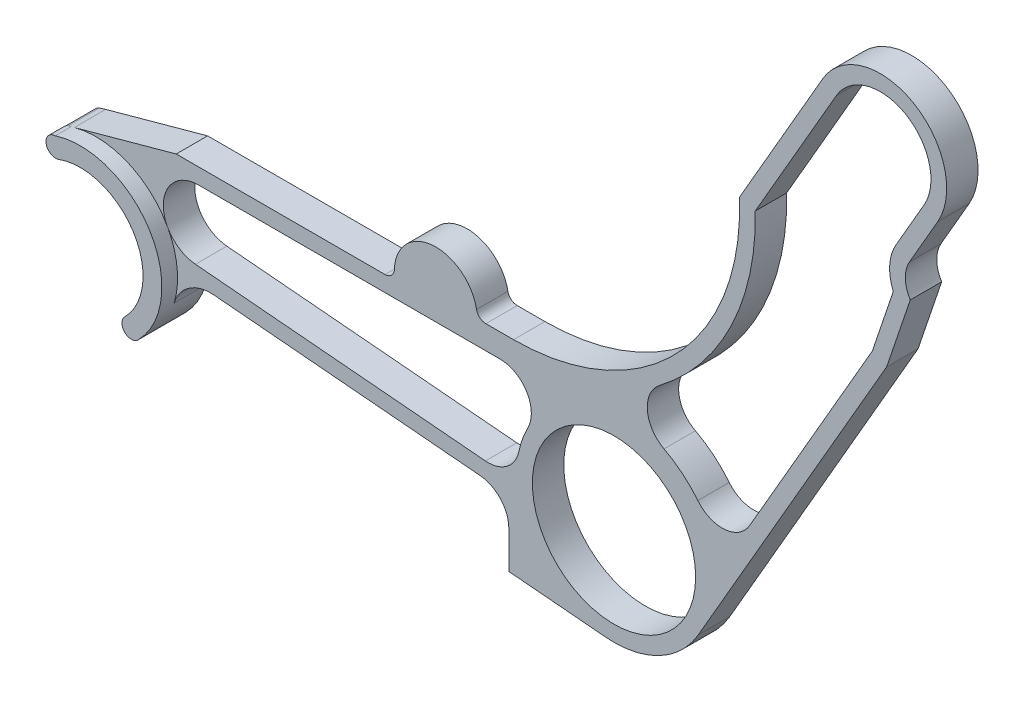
ISO-10303-21;
HEADER;
FILE_DESCRIPTION(('STEP AP214'),'2;1');
FILE_NAME('part.step','',(''),(''),'','','');
FILE_SCHEMA(('AUTOMOTIVE_DESIGN { 1 0 10303 214 1 1 1 1 }'));
ENDSEC;
DATA;
#1=APPLICATION_CONTEXT('core data for automotive mechanical design processes');
#2=APPLICATION_PROTOCOL_DEFINITION('international standard','automotive_design',2000,#1);
#3=PRODUCT_CONTEXT('',#1,'mechanical');
#4=PRODUCT('Part','Part','',(#3));
#5=PRODUCT_RELATED_PRODUCT_CATEGORY('part','',(#4));
#6=PRODUCT_DEFINITION_FORMATION('','',#4);
#7=PRODUCT_DEFINITION_CONTEXT('part definition',#1,'design');
#8=PRODUCT_DEFINITION('design','',#6,#7);
#9=PRODUCT_DEFINITION_SHAPE('','',#8);
#10=(LENGTH_UNIT() NAMED_UNIT(*) SI_UNIT(.MILLI.,.METRE.));
#11=(NAMED_UNIT(*) PLANE_ANGLE_UNIT() SI_UNIT($,.RADIAN.));
#12=(NAMED_UNIT(*) SI_UNIT($,.STERADIAN.) SOLID_ANGLE_UNIT());
#13=UNCERTAINTY_MEASURE_WITH_UNIT(LENGTH_MEASURE(1.E-05),#10,'distance_accuracy_value','');
#14=(GEOMETRIC_REPRESENTATION_CONTEXT(3) GLOBAL_UNCERTAINTY_ASSIGNED_CONTEXT((#13)) GLOBAL_UNIT_ASSIGNED_CONTEXT((#10,
#11,#12)) REPRESENTATION_CONTEXT('',''));
#15=CARTESIAN_POINT('',(0.,0.,0.));
#16=DIRECTION('',(0.,0.,1.));
#17=DIRECTION('',(1.,0.,0.));
#18=AXIS2_PLACEMENT_3D('',#15,#16,#17);
#19=CARTESIAN_POINT('',(0.,0.,10.));
#20=DIRECTION('',(0.,0.,1.));
#21=DIRECTION('',(1.,0.,0.));
#22=AXIS2_PLACEMENT_3D('',#19,#20,#21);
#23=PLANE('',#22);
#24=CARTESIAN_POINT('',(-100.007487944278,-12.4194998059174,10.));
#25=DIRECTION('',(0.,0.,1.));
#26=DIRECTION('',(1.,0.,0.));
#27=AXIS2_PLACEMENT_3D('',#24,#25,#26);
#28=CIRCLE('',#27,3.);
#29=CARTESIAN_POINT('',(-102.806416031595,-11.3396842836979,10.));
#30=VERTEX_POINT('',#29);
#31=CARTESIAN_POINT('',(-98.9698793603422,-15.2343476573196,10.));
#32=VERTEX_POINT('',#31);
#33=EDGE_CURVE('E521',#30,#32,#28,.T.);
#34=ORIENTED_EDGE('',*,*,#33,.T.);
#35=CARTESIAN_POINT('',(-99.8972660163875,-12.310922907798,10.));
#36=DIRECTION('',(0.,0.,1.));
#37=DIRECTION('',(-1.,0.,0.));
#38=AXIS2_PLACEMENT_3D('',#35,#36,#37);
#39=CIRCLE('',#38,3.06699499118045);
#40=EDGE_CURVE('E49',#30,#32,#39,.T.);
#41=ORIENTED_EDGE('',*,*,#40,.F.);
#42=EDGE_LOOP('',(#34,#41));
#43=FACE_BOUND('',#42,.T.);
#44=ADVANCED_FACE('F35',(#43),#23,.T.);
#45=CARTESIAN_POINT('',(72.9475111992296,-34.,10.));
#46=DIRECTION('',(0.,0.,1.));
#47=DIRECTION('',(1.,0.,0.));
#48=AXIS2_PLACEMENT_3D('',#45,#46,#47);
#49=CIRCLE('',#48,26.);
#50=CARTESIAN_POINT('',(98.9475111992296,-34.,10.));
#51=VERTEX_POINT('',#50);
#52=EDGE_CURVE('E525',#51,#51,#49,.T.);
#53=ORIENTED_EDGE('',*,*,#52,.F.);
#54=EDGE_LOOP('',(#53));
#55=FACE_BOUND('',#54,.T.);
#56=CARTESIAN_POINT('',(40.9475111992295,74.5,10.));
#57=DIRECTION('',(0.,0.,-1.));
#58=DIRECTION('',(1.,0.,0.));
#59=AXIS2_PLACEMENT_3D('',#56,#57,#58);
#60=CIRCLE('',#59,77.);
#61=CARTESIAN_POINT('',(117.922531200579,76.4611975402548,10.));
#62=VERTEX_POINT('',#61);
#63=CARTESIAN_POINT('',(87.4901648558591,13.1584855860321,10.));
#64=VERTEX_POINT('',#63);
#65=EDGE_CURVE('E375',#62,#64,#60,.T.);
#66=ORIENTED_EDGE('',*,*,#65,.F.);
#67=DIRECTION('',(-0.499999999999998,-0.86602540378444,0.));
#68=VECTOR('',#67,1.);
#69=CARTESIAN_POINT('',(143.777638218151,121.243556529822,10.));
#70=LINE('',#69,#68);
#71=CARTESIAN_POINT('',(143.777638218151,121.243556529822,10.));
#72=VERTEX_POINT('',#71);
#73=EDGE_CURVE('E390',#72,#62,#70,.T.);
#74=ORIENTED_EDGE('',*,*,#73,.F.);
#75=CARTESIAN_POINT('',(157.755759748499,113.17328430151,10.));
#76=DIRECTION('',(0.,0.,1.));
#77=DIRECTION('',(1.,0.,0.));
#78=AXIS2_PLACEMENT_3D('',#75,#76,#77);
#79=CIRCLE('',#78,16.1405444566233);
#80=CARTESIAN_POINT('',(171.733881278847,105.103012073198,10.));
#81=VERTEX_POINT('',#80);
#82=EDGE_CURVE('E440',#81,#72,#79,.T.);
#83=ORIENTED_EDGE('',*,*,#82,.F.);
#84=DIRECTION('',(0.5,0.866025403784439,0.));
#85=VECTOR('',#84,1.);
#86=CARTESIAN_POINT('',(162.743001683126,89.530351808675,10.));
#87=LINE('',#86,#85);
#88=CARTESIAN_POINT('',(162.743001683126,89.530351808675,10.));
#89=VERTEX_POINT('',#88);
#90=EDGE_CURVE('E437',#89,#81,#87,.T.);
#91=ORIENTED_EDGE('',*,*,#90,.F.);
#92=CARTESIAN_POINT('',(175.733382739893,82.030351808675,10.));
#93=DIRECTION('',(0.,0.,-1.));
#94=DIRECTION('',(1.,0.,0.));
#95=AXIS2_PLACEMENT_3D('',#92,#93,#94);
#96=CIRCLE('',#95,15.);
#97=CARTESIAN_POINT('',(161.895197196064,76.2420341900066,10.));
#98=VERTEX_POINT('',#97);
#99=EDGE_CURVE('E434',#98,#89,#96,.T.);
#100=ORIENTED_EDGE('',*,*,#99,.F.);
#101=DIRECTION('',(0.320370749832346,0.947292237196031,0.));
#102=VECTOR('',#101,1.);
#103=CARTESIAN_POINT('',(155.216518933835,56.4941012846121,10.));
#104=LINE('',#103,#102);
#105=CARTESIAN_POINT('',(155.216518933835,56.4941012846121,10.));
#106=VERTEX_POINT('',#105);
#107=EDGE_CURVE('E431',#106,#98,#104,.T.);
#108=ORIENTED_EDGE('',*,*,#107,.F.);
#109=DIRECTION('',(0.500000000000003,0.866025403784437,0.));
#110=VECTOR('',#109,1.);
#111=CARTESIAN_POINT('',(116.103019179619,-11.2524675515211,10.));
#112=LINE('',#111,#110);
#113=CARTESIAN_POINT('',(116.103019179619,-11.2524675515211,10.));
#114=VERTEX_POINT('',#113);
#115=EDGE_CURVE('E428',#114,#106,#112,.T.);
#116=ORIENTED_EDGE('',*,*,#115,.F.);
#117=CARTESIAN_POINT('',(107.442765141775,-6.25246755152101,10.));
#118=DIRECTION('',(0.,0.,1.));
#119=DIRECTION('',(1.,0.,0.));
#120=AXIS2_PLACEMENT_3D('',#117,#118,#119);
#121=CIRCLE('',#120,10.);
#122=CARTESIAN_POINT('',(99.6507795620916,-12.5202391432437,10.));
#123=VERTEX_POINT('',#122);
#124=EDGE_CURVE('E425',#123,#114,#121,.T.);
#125=ORIENTED_EDGE('',*,*,#124,.F.);
#126=CARTESIAN_POINT('',(72.9475111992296,-34.,10.));
#127=DIRECTION('',(0.,0.,-1.));
#128=DIRECTION('',(-1.,0.,0.));
#129=AXIS2_PLACEMENT_3D('',#126,#127,#128);
#130=CIRCLE('',#129,34.2701716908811);
#131=CARTESIAN_POINT('',(88.8843210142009,-3.66087079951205,10.));
#132=VERTEX_POINT('',#131);
#133=EDGE_CURVE('E422',#132,#123,#130,.T.);
#134=ORIENTED_EDGE('',*,*,#133,.F.);
#135=CARTESIAN_POINT('',(93.534665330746,5.19205514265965,10.));
#136=DIRECTION('',(0.,0.,1.));
#137=DIRECTION('',(1.,0.,0.));
#138=AXIS2_PLACEMENT_3D('',#135,#136,#137);
#139=CIRCLE('',#138,10.);
#140=EDGE_CURVE('E419',#64,#132,#139,.T.);
#141=ORIENTED_EDGE('',*,*,#140,.F.);
#142=EDGE_LOOP('',(#66,#74,#83,#91,#100,#108,#116,#125,#134,#141));
#143=FACE_BOUND('',#142,.T.);
#144=DIRECTION('',(-0.964179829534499,-0.265249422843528,0.));
#145=VECTOR('',#144,1.);
#146=CARTESIAN_POINT('',(-4.67760867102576,17.0030753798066,10.));
#147=LINE('',#146,#145);
#148=CARTESIAN_POINT('',(-66.4836708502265,0.,10.));
#149=VERTEX_POINT('',#148);
#150=CARTESIAN_POINT('',(-98.9489737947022,-8.93132443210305,10.));
#151=VERTEX_POINT('',#150);
#152=EDGE_CURVE('E519',#149,#151,#147,.T.);
#153=ORIENTED_EDGE('',*,*,#152,.T.);
#154=CARTESIAN_POINT('',(-92.0524888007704,-34.,10.));
#155=DIRECTION('',(0.,0.,1.));
#156=DIRECTION('',(1.,0.,0.));
#157=AXIS2_PLACEMENT_3D('',#154,#155,#156);
#158=CIRCLE('',#157,26.);
#159=CARTESIAN_POINT('',(-69.2225907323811,-21.5583058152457,10.));
#160=VERTEX_POINT('',#159);
#161=EDGE_CURVE('E678',#160,#151,#158,.T.);
#162=ORIENTED_EDGE('',*,*,#161,.F.);
#163=CARTESIAN_POINT('',(-59.3888817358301,-16.1991929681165,10.));
#164=DIRECTION('',(0.,0.,1.));
#165=DIRECTION('',(1.,0.,0.));
#166=AXIS2_PLACEMENT_3D('',#163,#164,#165);
#167=CIRCLE('',#166,11.1991929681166);
#168=CARTESIAN_POINT('',(-59.3888817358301,-5.,10.));
#169=VERTEX_POINT('',#168);
#170=EDGE_CURVE('E356',#169,#160,#167,.T.);
#171=ORIENTED_EDGE('',*,*,#170,.F.);
#172=DIRECTION('',(-1.,0.,0.));
#173=VECTOR('',#172,1.);
#174=CARTESIAN_POINT('',(-59.3888817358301,-5.,10.));
#175=LINE('',#174,#173);
#176=CARTESIAN_POINT('',(36.6157069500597,-5.,10.));
#177=VERTEX_POINT('',#176);
#178=EDGE_CURVE('E340',#177,#169,#175,.T.);
#179=ORIENTED_EDGE('',*,*,#178,.F.);
#180=CARTESIAN_POINT('',(36.6157069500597,-15.,10.));
#181=DIRECTION('',(0.,0.,1.));
#182=DIRECTION('',(-1.,0.,0.));
#183=AXIS2_PLACEMENT_3D('',#180,#181,#182);
#184=CIRCLE('',#183,10.);
#185=CARTESIAN_POINT('',(45.4771226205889,-19.6341463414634,10.));
#186=VERTEX_POINT('',#185);
#187=EDGE_CURVE('E368',#186,#177,#184,.T.);
#188=ORIENTED_EDGE('',*,*,#187,.F.);
#189=CARTESIAN_POINT('',(72.9475111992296,-34.,10.));
#190=DIRECTION('',(0.,0.,-1.));
#191=DIRECTION('',(1.,0.,0.));
#192=AXIS2_PLACEMENT_3D('',#189,#190,#191);
#193=CIRCLE('',#192,31.);
#194=CARTESIAN_POINT('',(42.6254673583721,-27.5522362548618,10.));
#195=VERTEX_POINT('',#194);
#196=EDGE_CURVE('E365',#195,#186,#193,.T.);
#197=ORIENTED_EDGE('',*,*,#196,.F.);
#198=CARTESIAN_POINT('',(32.8441628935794,-25.4723124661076,10.));
#199=DIRECTION('',(0.,0.,1.));
#200=DIRECTION('',(-1.,0.,0.));
#201=AXIS2_PLACEMENT_3D('',#198,#199,#200);
#202=CIRCLE('',#201,10.);
#203=CARTESIAN_POINT('',(31.9726054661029,-35.434259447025,10.));
#204=VERTEX_POINT('',#203);
#205=EDGE_CURVE('E362',#204,#195,#202,.T.);
#206=ORIENTED_EDGE('',*,*,#205,.F.);
#207=DIRECTION('',(0.996194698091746,-0.0871557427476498,0.));
#208=VECTOR('',#207,1.);
#209=CARTESIAN_POINT('',(31.9726054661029,-35.434259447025,10.));
#210=LINE('',#209,#208);
#211=CARTESIAN_POINT('',(-60.3649557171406,-27.3557696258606,10.));
#212=VERTEX_POINT('',#211);
#213=EDGE_CURVE('E359',#212,#204,#210,.T.);
#214=ORIENTED_EDGE('',*,*,#213,.F.);
#215=EDGE_CURVE('E331',#160,#212,#167,.T.);
#216=ORIENTED_EDGE('',*,*,#215,.F.);
#217=CARTESIAN_POINT('',(-67.1457795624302,-41.4602838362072,10.));
#218=VERTEX_POINT('',#217);
#219=EDGE_CURVE('E325',#218,#160,#158,.T.);
#220=ORIENTED_EDGE('',*,*,#219,.F.);
#221=CARTESIAN_POINT('',(-55.5662535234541,-44.9286886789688,10.));
#222=DIRECTION('',(0.,0.,1.));
#223=DIRECTION('',(1.,0.,0.));
#224=AXIS2_PLACEMENT_3D('',#221,#222,#223);
#225=CIRCLE('',#224,12.0878143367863);
#226=CARTESIAN_POINT('',(-54.5127310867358,-32.8868721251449,10.));
#227=VERTEX_POINT('',#226);
#228=EDGE_CURVE('E466',#227,#218,#225,.T.);
#229=ORIENTED_EDGE('',*,*,#228,.F.);
#230=DIRECTION('',(-0.996194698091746,0.0871557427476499,0.));
#231=VECTOR('',#230,1.);
#232=CARTESIAN_POINT('',(-3.26945814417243,-37.3700775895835,10.));
#233=LINE('',#232,#231);
#234=CARTESIAN_POINT('',(30.3190686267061,-40.3086929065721,10.));
#235=VERTEX_POINT('',#234);
#236=EDGE_CURVE('E468',#235,#227,#233,.T.);
#237=ORIENTED_EDGE('',*,*,#236,.F.);
#238=CARTESIAN_POINT('',(29.4475111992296,-50.2706398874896,10.));
#239=DIRECTION('',(0.,0.,1.));
#240=DIRECTION('',(1.,0.,0.));
#241=AXIS2_PLACEMENT_3D('',#238,#239,#240);
#242=CIRCLE('',#241,10.);
#243=CARTESIAN_POINT('',(39.4475111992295,-50.2706398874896,10.));
#244=VERTEX_POINT('',#243);
#245=EDGE_CURVE('E472',#244,#235,#242,.T.);
#246=ORIENTED_EDGE('',*,*,#245,.F.);
#247=DIRECTION('',(0.,1.,0.));
#248=VECTOR('',#247,1.);
#249=CARTESIAN_POINT('',(39.4475111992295,0.,10.));
#250=LINE('',#249,#248);
#251=CARTESIAN_POINT('',(39.4475111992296,-62.1875447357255,10.));
#252=VERTEX_POINT('',#251);
#253=EDGE_CURVE('E475',#252,#244,#250,.T.);
#254=ORIENTED_EDGE('',*,*,#253,.F.);
#255=DIRECTION('',(-0.996194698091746,0.0871557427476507,0.));
#256=VECTOR('',#255,1.);
#257=CARTESIAN_POINT('',(-5.09972874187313,-58.2901662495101,10.));
#258=LINE('',#257,#256);
#259=CARTESIAN_POINT('',(70.2456831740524,-64.8820356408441,10.));
#260=VERTEX_POINT('',#259);
#261=EDGE_CURVE('E478',#260,#252,#258,.T.);
#262=ORIENTED_EDGE('',*,*,#261,.F.);
#263=CARTESIAN_POINT('',(72.9475111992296,-34.,10.));
#264=DIRECTION('',(0.,0.,1.));
#265=DIRECTION('',(1.,0.,0.));
#266=AXIS2_PLACEMENT_3D('',#263,#264,#265);
#267=CIRCLE('',#266,31.);
#268=CARTESIAN_POINT('',(99.7942987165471,-49.5000000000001,10.));
#269=VERTEX_POINT('',#268);
#270=EDGE_CURVE('E481',#269,#260,#267,.F.);
#271=ORIENTED_EDGE('',*,*,#270,.F.);
#272=DIRECTION('',(-0.500000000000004,-0.866025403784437,0.));
#273=VECTOR('',#272,1.);
#274=CARTESIAN_POINT('',(96.279852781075,-55.5871989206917,10.));
#275=LINE('',#274,#273);
#276=CARTESIAN_POINT('',(159.794298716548,54.4230484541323,10.));
#277=VERTEX_POINT('',#276);
#278=EDGE_CURVE('E484',#277,#269,#275,.T.);
#279=ORIENTED_EDGE('',*,*,#278,.F.);
#280=DIRECTION('',(-0.320370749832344,-0.947292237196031,0.));
#281=VECTOR('',#280,1.);
#282=CARTESIAN_POINT('',(126.876860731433,-42.9092875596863,10.));
#283=LINE('',#282,#281);
#284=CARTESIAN_POINT('',(167.308875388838,76.6426179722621,10.));
#285=VERTEX_POINT('',#284);
#286=EDGE_CURVE('E487',#285,#277,#283,.T.);
#287=ORIENTED_EDGE('',*,*,#286,.F.);
#288=CARTESIAN_POINT('',(175.733382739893,82.030351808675,10.));
#289=DIRECTION('',(0.,0.,1.));
#290=DIRECTION('',(1.,0.,0.));
#291=AXIS2_PLACEMENT_3D('',#288,#289,#290);
#292=CIRCLE('',#291,10.);
#293=CARTESIAN_POINT('',(167.073128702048,87.030351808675,10.));
#294=VERTEX_POINT('',#293);
#295=EDGE_CURVE('E490',#294,#285,#292,.T.);
#296=ORIENTED_EDGE('',*,*,#295,.F.);
#297=DIRECTION('',(-0.499999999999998,-0.86602540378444,0.));
#298=VECTOR('',#297,1.);
#299=CARTESIAN_POINT('',(87.6195987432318,-50.5871989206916,10.));
#300=LINE('',#299,#298);
#301=CARTESIAN_POINT('',(176.064008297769,102.603012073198,10.));
#302=VERTEX_POINT('',#301);
#303=EDGE_CURVE('E493',#302,#294,#300,.T.);
#304=ORIENTED_EDGE('',*,*,#303,.F.);
#305=CARTESIAN_POINT('',(157.755759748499,113.17328430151,10.));
#306=DIRECTION('',(0.,0.,1.));
#307=DIRECTION('',(1.,0.,0.));
#308=AXIS2_PLACEMENT_3D('',#305,#306,#307);
#309=CIRCLE('',#308,21.1405444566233);
#310=CARTESIAN_POINT('',(139.447511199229,123.743556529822,10.));
#311=VERTEX_POINT('',#310);
#312=EDGE_CURVE('E496',#311,#302,#309,.F.);
#313=ORIENTED_EDGE('',*,*,#312,.F.);
#314=DIRECTION('',(0.499999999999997,0.86602540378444,0.));
#315=VECTOR('',#314,1.);
#316=CARTESIAN_POINT('',(51.0031016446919,-29.4466544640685,10.));
#317=LINE('',#316,#315);
#318=CARTESIAN_POINT('',(112.875495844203,77.7194758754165,10.));
#319=VERTEX_POINT('',#318);
#320=EDGE_CURVE('E499',#319,#311,#317,.T.);
#321=ORIENTED_EDGE('',*,*,#320,.F.);
#322=CARTESIAN_POINT('',(40.9475111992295,74.5,10.));
#323=DIRECTION('',(0.,0.,1.));
#324=DIRECTION('',(1.,0.,0.));
#325=AXIS2_PLACEMENT_3D('',#322,#323,#324);
#326=CIRCLE('',#325,72.);
#327=CARTESIAN_POINT('',(40.9475111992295,2.5,10.));
#328=VERTEX_POINT('',#327);
#329=EDGE_CURVE('E502',#328,#319,#326,.T.);
#330=ORIENTED_EDGE('',*,*,#329,.F.);
#331=DIRECTION('',(1.,0.,0.));
#332=VECTOR('',#331,1.);
#333=CARTESIAN_POINT('',(0.,2.50000000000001,10.));
#334=LINE('',#333,#332);
#335=CARTESIAN_POINT('',(32.1194544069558,2.5,10.));
#336=VERTEX_POINT('',#335);
#337=EDGE_CURVE('E505',#336,#328,#334,.T.);
#338=ORIENTED_EDGE('',*,*,#337,.F.);
#339=CARTESIAN_POINT('',(32.1194544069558,5.5,10.));
#340=DIRECTION('',(0.,0.,1.));
#341=DIRECTION('',(1.,0.,0.));
#342=AXIS2_PLACEMENT_3D('',#339,#340,#341);
#343=CIRCLE('',#342,3.);
#344=CARTESIAN_POINT('',(29.1713198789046,4.94456971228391,10.));
#345=VERTEX_POINT('',#344);
#346=EDGE_CURVE('E508',#345,#336,#343,.T.);
#347=ORIENTED_EDGE('',*,*,#346,.F.);
#348=CARTESIAN_POINT('',(16.1959374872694,2.5,10.));
#349=DIRECTION('',(0.,0.,1.));
#350=DIRECTION('',(1.,0.,0.));
#351=AXIS2_PLACEMENT_3D('',#348,#349,#350);
#352=CIRCLE('',#351,13.2036536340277);
#353=CARTESIAN_POINT('',(2.99857140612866,2.90742828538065,10.));
#354=VERTEX_POINT('',#353);
#355=EDGE_CURVE('E511',#354,#345,#352,.F.);
#356=ORIENTED_EDGE('',*,*,#355,.F.);
#357=CARTESIAN_POINT('',(0.,3.,10.));
#358=DIRECTION('',(0.,0.,1.));
#359=DIRECTION('',(1.,0.,0.));
#360=AXIS2_PLACEMENT_3D('',#357,#358,#359);
#361=CIRCLE('',#360,3.);
#362=CARTESIAN_POINT('',(0.,0.,10.));
#363=VERTEX_POINT('',#362);
#364=EDGE_CURVE('E514',#363,#354,#361,.T.);
#365=ORIENTED_EDGE('',*,*,#364,.F.);
#366=DIRECTION('',(-1.,0.,0.));
#367=VECTOR('',#366,1.);
#368=CARTESIAN_POINT('',(0.,0.,10.));
#369=LINE('',#368,#367);
#370=EDGE_CURVE('E517',#363,#149,#369,.T.);
#371=ORIENTED_EDGE('',*,*,#370,.T.);
#372=EDGE_LOOP('',(#153,#162,#171,#179,#188,#197,#206,#214,#216,#220,#229,#237,#246,#254,#262,
#271,#279,#287,#296,#304,#313,#321,#330,#338,#347,#356,#365,#371));
#373=FACE_BOUND('',#372,.T.);
#374=ADVANCED_FACE('F660',(#55,#143,#373),#23,.T.);
#375=CARTESIAN_POINT('',(-55.5662535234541,-44.9286886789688,10.));
#376=DIRECTION('',(0.,0.,-1.));
#377=DIRECTION('',(-1.,0.,0.));
#378=AXIS2_PLACEMENT_3D('',#375,#376,#377);
#379=CYLINDRICAL_SURFACE('',#378,12.0878143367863);
#380=CARTESIAN_POINT('',(-55.5662535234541,-44.9286886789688,0.));
#381=DIRECTION('',(0.,0.,1.));
#382=DIRECTION('',(1.,0.,0.));
#383=AXIS2_PLACEMENT_3D('',#380,#381,#382);
#384=CIRCLE('',#383,12.0878143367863);
#385=CARTESIAN_POINT('',(-54.5127310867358,-32.8868721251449,0.));
#386=VERTEX_POINT('',#385);
#387=CARTESIAN_POINT('',(-67.1457795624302,-41.4602838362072,0.));
#388=VERTEX_POINT('',#387);
#389=EDGE_CURVE('E531',#386,#388,#384,.T.);
#390=ORIENTED_EDGE('',*,*,#389,.F.);
#391=DIRECTION('',(0.,0.,-1.));
#392=VECTOR('',#391,1.);
#393=CARTESIAN_POINT('',(-54.5127310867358,-32.8868721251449,10.));
#394=LINE('',#393,#392);
#395=EDGE_CURVE('E43',#227,#386,#394,.T.);
#396=ORIENTED_EDGE('',*,*,#395,.F.);
#397=ORIENTED_EDGE('',*,*,#228,.T.);
#398=DIRECTION('',(0.,0.,-1.));
#399=VECTOR('',#398,1.);
#400=CARTESIAN_POINT('',(-67.1457795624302,-41.4602838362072,10.));
#401=LINE('',#400,#399);
#402=EDGE_CURVE('E11',#218,#388,#401,.T.);
#403=ORIENTED_EDGE('',*,*,#402,.T.);
#404=EDGE_LOOP('',(#390,#396,#397,#403));
#405=FACE_BOUND('',#404,.T.);
#406=ADVANCED_FACE('F37',(#405),#379,.F.);
#407=CARTESIAN_POINT('',(-3.26945814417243,-37.3700775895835,10.));
#408=DIRECTION('',(-0.0871557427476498,-0.996194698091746,0.));
#409=DIRECTION('',(0.996194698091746,-0.0871557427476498,0.));
#410=AXIS2_PLACEMENT_3D('',#407,#408,#409);
#411=PLANE('',#410);
#412=DIRECTION('',(-0.996194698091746,0.0871557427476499,0.));
#413=VECTOR('',#412,1.);
#414=CARTESIAN_POINT('',(-3.26945814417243,-37.3700775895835,0.));
#415=LINE('',#414,#413);
#416=CARTESIAN_POINT('',(30.3190686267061,-40.3086929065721,0.));
#417=VERTEX_POINT('',#416);
#418=EDGE_CURVE('E535',#417,#386,#415,.T.);
#419=ORIENTED_EDGE('',*,*,#418,.F.);
#420=DIRECTION('',(0.,0.,-1.));
#421=VECTOR('',#420,1.);
#422=CARTESIAN_POINT('',(30.3190686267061,-40.3086929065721,10.));
#423=LINE('',#422,#421);
#424=EDGE_CURVE('E641',#235,#417,#423,.T.);
#425=ORIENTED_EDGE('',*,*,#424,.F.);
#426=ORIENTED_EDGE('',*,*,#236,.T.);
#427=ORIENTED_EDGE('',*,*,#395,.T.);
#428=EDGE_LOOP('',(#419,#425,#426,#427));
#429=FACE_BOUND('',#428,.T.);
#430=ADVANCED_FACE('F645',(#429),#411,.T.);
#431=CARTESIAN_POINT('',(29.4475111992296,-50.2706398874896,10.));
#432=DIRECTION('',(0.,0.,-1.));
#433=DIRECTION('',(-1.,0.,0.));
#434=AXIS2_PLACEMENT_3D('',#431,#432,#433);
#435=CYLINDRICAL_SURFACE('',#434,10.);
#436=CARTESIAN_POINT('',(29.4475111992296,-50.2706398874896,0.));
#437=DIRECTION('',(0.,0.,1.));
#438=DIRECTION('',(1.,0.,0.));
#439=AXIS2_PLACEMENT_3D('',#436,#437,#438);
#440=CIRCLE('',#439,10.);
#441=CARTESIAN_POINT('',(39.4475111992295,-50.2706398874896,0.));
#442=VERTEX_POINT('',#441);
#443=EDGE_CURVE('E538',#442,#417,#440,.T.);
#444=ORIENTED_EDGE('',*,*,#443,.F.);
#445=DIRECTION('',(0.,0.,-1.));
#446=VECTOR('',#445,1.);
#447=CARTESIAN_POINT('',(39.4475111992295,-50.2706398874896,10.));
#448=LINE('',#447,#446);
#449=EDGE_CURVE('E639',#244,#442,#448,.T.);
#450=ORIENTED_EDGE('',*,*,#449,.F.);
#451=ORIENTED_EDGE('',*,*,#245,.T.);
#452=ORIENTED_EDGE('',*,*,#424,.T.);
#453=EDGE_LOOP('',(#444,#450,#451,#452));
#454=FACE_BOUND('',#453,.T.);
#455=ADVANCED_FACE('F657',(#454),#435,.F.);
#456=CARTESIAN_POINT('',(39.4475111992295,0.,10.));
#457=DIRECTION('',(-1.,0.,0.));
#458=DIRECTION('',(0.,-1.,0.));
#459=AXIS2_PLACEMENT_3D('',#456,#457,#458);
#460=PLANE('',#459);
#461=DIRECTION('',(0.,1.,0.));
#462=VECTOR('',#461,1.);
#463=CARTESIAN_POINT('',(39.4475111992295,0.,0.));
#464=LINE('',#463,#462);
#465=CARTESIAN_POINT('',(39.4475111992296,-62.1875447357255,0.));
#466=VERTEX_POINT('',#465);
#467=EDGE_CURVE('E541',#466,#442,#464,.T.);
#468=ORIENTED_EDGE('',*,*,#467,.F.);
#469=DIRECTION('',(0.,0.,-1.));
#470=VECTOR('',#469,1.);
#471=CARTESIAN_POINT('',(39.4475111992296,-62.1875447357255,10.));
#472=LINE('',#471,#470);
#473=EDGE_CURVE('E637',#252,#466,#472,.T.);
#474=ORIENTED_EDGE('',*,*,#473,.F.);
#475=ORIENTED_EDGE('',*,*,#253,.T.);
#476=ORIENTED_EDGE('',*,*,#449,.T.);
#477=EDGE_LOOP('',(#468,#474,#475,#476));
#478=FACE_BOUND('',#477,.T.);
#479=ADVANCED_FACE('F739',(#478),#460,.T.);
#480=CARTESIAN_POINT('',(-5.09972874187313,-58.2901662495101,10.));
#481=DIRECTION('',(-0.0871557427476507,-0.996194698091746,0.));
#482=DIRECTION('',(0.996194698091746,-0.0871557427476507,0.));
#483=AXIS2_PLACEMENT_3D('',#480,#481,#482);
#484=PLANE('',#483);
#485=DIRECTION('',(-0.996194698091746,0.0871557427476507,0.));
#486=VECTOR('',#485,1.);
#487=CARTESIAN_POINT('',(-5.09972874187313,-58.2901662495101,0.));
#488=LINE('',#487,#486);
#489=CARTESIAN_POINT('',(70.2456831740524,-64.8820356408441,0.));
#490=VERTEX_POINT('',#489);
#491=EDGE_CURVE('E544',#490,#466,#488,.T.);
#492=ORIENTED_EDGE('',*,*,#491,.F.);
#493=DIRECTION('',(0.,0.,-1.));
#494=VECTOR('',#493,1.);
#495=CARTESIAN_POINT('',(70.2456831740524,-64.8820356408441,10.));
#496=LINE('',#495,#494);
#497=EDGE_CURVE('E635',#260,#490,#496,.T.);
#498=ORIENTED_EDGE('',*,*,#497,.F.);
#499=ORIENTED_EDGE('',*,*,#261,.T.);
#500=ORIENTED_EDGE('',*,*,#473,.T.);
#501=EDGE_LOOP('',(#492,#498,#499,#500));
#502=FACE_BOUND('',#501,.T.);
#503=ADVANCED_FACE('F737',(#502),#484,.T.);
#504=CARTESIAN_POINT('',(72.9475111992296,-34.,10.));
#505=DIRECTION('',(0.,0.,-1.));
#506=DIRECTION('',(-1.,0.,0.));
#507=AXIS2_PLACEMENT_3D('',#504,#505,#506);
#508=CYLINDRICAL_SURFACE('',#507,31.);
#509=CARTESIAN_POINT('',(72.9475111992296,-34.,0.));
#510=DIRECTION('',(0.,0.,1.));
#511=DIRECTION('',(1.,0.,0.));
#512=AXIS2_PLACEMENT_3D('',#509,#510,#511);
#513=CIRCLE('',#512,31.);
#514=CARTESIAN_POINT('',(99.7942987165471,-49.5000000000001,0.));
#515=VERTEX_POINT('',#514);
#516=EDGE_CURVE('E547',#515,#490,#513,.F.);
#517=ORIENTED_EDGE('',*,*,#516,.F.);
#518=DIRECTION('',(0.,0.,-1.));
#519=VECTOR('',#518,1.);
#520=CARTESIAN_POINT('',(99.7942987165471,-49.5000000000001,10.));
#521=LINE('',#520,#519);
#522=EDGE_CURVE('E633',#269,#515,#521,.T.);
#523=ORIENTED_EDGE('',*,*,#522,.F.);
#524=ORIENTED_EDGE('',*,*,#270,.T.);
#525=ORIENTED_EDGE('',*,*,#497,.T.);
#526=EDGE_LOOP('',(#517,#523,#524,#525));
#527=FACE_BOUND('',#526,.T.);
#528=ADVANCED_FACE('F733',(#527),#508,.T.);
#529=CARTESIAN_POINT('',(96.279852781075,-55.5871989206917,10.));
#530=DIRECTION('',(0.866025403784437,-0.500000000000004,0.));
#531=DIRECTION('',(0.500000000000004,0.866025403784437,0.));
#532=AXIS2_PLACEMENT_3D('',#529,#530,#531);
#533=PLANE('',#532);
#534=DIRECTION('',(-0.500000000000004,-0.866025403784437,0.));
#535=VECTOR('',#534,1.);
#536=CARTESIAN_POINT('',(96.279852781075,-55.5871989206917,0.));
#537=LINE('',#536,#535);
#538=CARTESIAN_POINT('',(159.794298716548,54.4230484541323,0.));
#539=VERTEX_POINT('',#538);
#540=EDGE_CURVE('E550',#539,#515,#537,.T.);
#541=ORIENTED_EDGE('',*,*,#540,.F.);
#542=DIRECTION('',(0.,0.,-1.));
#543=VECTOR('',#542,1.);
#544=CARTESIAN_POINT('',(159.794298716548,54.4230484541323,10.));
#545=LINE('',#544,#543);
#546=EDGE_CURVE('E631',#277,#539,#545,.T.);
#547=ORIENTED_EDGE('',*,*,#546,.F.);
#548=ORIENTED_EDGE('',*,*,#278,.T.);
#549=ORIENTED_EDGE('',*,*,#522,.T.);
#550=EDGE_LOOP('',(#541,#547,#548,#549));
#551=FACE_BOUND('',#550,.T.);
#552=ADVANCED_FACE('F729',(#551),#533,.T.);
#553=CARTESIAN_POINT('',(126.876860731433,-42.9092875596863,10.));
#554=DIRECTION('',(0.947292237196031,-0.320370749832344,0.));
#555=DIRECTION('',(0.320370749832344,0.947292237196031,0.));
#556=AXIS2_PLACEMENT_3D('',#553,#554,#555);
#557=PLANE('',#556);
#558=DIRECTION('',(-0.320370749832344,-0.947292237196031,0.));
#559=VECTOR('',#558,1.);
#560=CARTESIAN_POINT('',(126.876860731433,-42.9092875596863,0.));
#561=LINE('',#560,#559);
#562=CARTESIAN_POINT('',(167.308875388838,76.6426179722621,0.));
#563=VERTEX_POINT('',#562);
#564=EDGE_CURVE('E553',#563,#539,#561,.T.);
#565=ORIENTED_EDGE('',*,*,#564,.F.);
#566=DIRECTION('',(0.,0.,-1.));
#567=VECTOR('',#566,1.);
#568=CARTESIAN_POINT('',(167.308875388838,76.6426179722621,10.));
#569=LINE('',#568,#567);
#570=EDGE_CURVE('E629',#285,#563,#569,.T.);
#571=ORIENTED_EDGE('',*,*,#570,.F.);
#572=ORIENTED_EDGE('',*,*,#286,.T.);
#573=ORIENTED_EDGE('',*,*,#546,.T.);
#574=EDGE_LOOP('',(#565,#571,#572,#573));
#575=FACE_BOUND('',#574,.T.);
#576=ADVANCED_FACE('F725',(#575),#557,.T.);
#577=CARTESIAN_POINT('',(175.733382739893,82.030351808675,10.));
#578=DIRECTION('',(0.,0.,-1.));
#579=DIRECTION('',(-1.,0.,0.));
#580=AXIS2_PLACEMENT_3D('',#577,#578,#579);
#581=CYLINDRICAL_SURFACE('',#580,10.);
#582=CARTESIAN_POINT('',(175.733382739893,82.030351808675,0.));
#583=DIRECTION('',(0.,0.,1.));
#584=DIRECTION('',(1.,0.,0.));
#585=AXIS2_PLACEMENT_3D('',#582,#583,#584);
#586=CIRCLE('',#585,10.);
#587=CARTESIAN_POINT('',(167.073128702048,87.030351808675,0.));
#588=VERTEX_POINT('',#587);
#589=EDGE_CURVE('E556',#588,#563,#586,.T.);
#590=ORIENTED_EDGE('',*,*,#589,.F.);
#591=DIRECTION('',(0.,0.,-1.));
#592=VECTOR('',#591,1.);
#593=CARTESIAN_POINT('',(167.073128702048,87.030351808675,10.));
#594=LINE('',#593,#592);
#595=EDGE_CURVE('E627',#294,#588,#594,.T.);
#596=ORIENTED_EDGE('',*,*,#595,.F.);
#597=ORIENTED_EDGE('',*,*,#295,.T.);
#598=ORIENTED_EDGE('',*,*,#570,.T.);
#599=EDGE_LOOP('',(#590,#596,#597,#598));
#600=FACE_BOUND('',#599,.T.);
#601=ADVANCED_FACE('F721',(#600),#581,.F.);
#602=CARTESIAN_POINT('',(87.6195987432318,-50.5871989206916,10.));
#603=DIRECTION('',(0.86602540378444,-0.499999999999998,0.));
#604=DIRECTION('',(0.499999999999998,0.86602540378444,0.));
#605=AXIS2_PLACEMENT_3D('',#602,#603,#604);
#606=PLANE('',#605);
#607=DIRECTION('',(-0.499999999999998,-0.86602540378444,0.));
#608=VECTOR('',#607,1.);
#609=CARTESIAN_POINT('',(87.6195987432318,-50.5871989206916,0.));
#610=LINE('',#609,#608);
#611=CARTESIAN_POINT('',(176.064008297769,102.603012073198,0.));
#612=VERTEX_POINT('',#611);
#613=EDGE_CURVE('E559',#612,#588,#610,.T.);
#614=ORIENTED_EDGE('',*,*,#613,.F.);
#615=DIRECTION('',(0.,0.,-1.));
#616=VECTOR('',#615,1.);
#617=CARTESIAN_POINT('',(176.064008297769,102.603012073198,10.));
#618=LINE('',#617,#616);
#619=EDGE_CURVE('E625',#302,#612,#618,.T.);
#620=ORIENTED_EDGE('',*,*,#619,.F.);
#621=ORIENTED_EDGE('',*,*,#303,.T.);
#622=ORIENTED_EDGE('',*,*,#595,.T.);
#623=EDGE_LOOP('',(#614,#620,#621,#622));
#624=FACE_BOUND('',#623,.T.);
#625=ADVANCED_FACE('F717',(#624),#606,.T.);
#626=CARTESIAN_POINT('',(157.755759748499,113.17328430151,10.));
#627=DIRECTION('',(0.,0.,-1.));
#628=DIRECTION('',(-1.,0.,0.));
#629=AXIS2_PLACEMENT_3D('',#626,#627,#628);
#630=CYLINDRICAL_SURFACE('',#629,21.1405444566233);
#631=CARTESIAN_POINT('',(157.755759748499,113.17328430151,0.));
#632=DIRECTION('',(0.,0.,1.));
#633=DIRECTION('',(1.,0.,0.));
#634=AXIS2_PLACEMENT_3D('',#631,#632,#633);
#635=CIRCLE('',#634,21.1405444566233);
#636=CARTESIAN_POINT('',(139.447511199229,123.743556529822,0.));
#637=VERTEX_POINT('',#636);
#638=EDGE_CURVE('E562',#637,#612,#635,.F.);
#639=ORIENTED_EDGE('',*,*,#638,.F.);
#640=DIRECTION('',(0.,0.,-1.));
#641=VECTOR('',#640,1.);
#642=CARTESIAN_POINT('',(139.447511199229,123.743556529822,10.));
#643=LINE('',#642,#641);
#644=EDGE_CURVE('E623',#311,#637,#643,.T.);
#645=ORIENTED_EDGE('',*,*,#644,.F.);
#646=ORIENTED_EDGE('',*,*,#312,.T.);
#647=ORIENTED_EDGE('',*,*,#619,.T.);
#648=EDGE_LOOP('',(#639,#645,#646,#647));
#649=FACE_BOUND('',#648,.T.);
#650=ADVANCED_FACE('F713',(#649),#630,.T.);
#651=CARTESIAN_POINT('',(51.0031016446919,-29.4466544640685,10.));
#652=DIRECTION('',(-0.86602540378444,0.499999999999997,0.));
#653=DIRECTION('',(-0.499999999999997,-0.86602540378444,0.));
#654=AXIS2_PLACEMENT_3D('',#651,#652,#653);
#655=PLANE('',#654);
#656=DIRECTION('',(0.499999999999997,0.86602540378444,0.));
#657=VECTOR('',#656,1.);
#658=CARTESIAN_POINT('',(51.0031016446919,-29.4466544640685,0.));
#659=LINE('',#658,#657);
#660=CARTESIAN_POINT('',(112.875495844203,77.7194758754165,0.));
#661=VERTEX_POINT('',#660);
#662=EDGE_CURVE('E565',#661,#637,#659,.T.);
#663=ORIENTED_EDGE('',*,*,#662,.F.);
#664=DIRECTION('',(0.,0.,-1.));
#665=VECTOR('',#664,1.);
#666=CARTESIAN_POINT('',(112.875495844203,77.7194758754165,10.));
#667=LINE('',#666,#665);
#668=EDGE_CURVE('E621',#319,#661,#667,.T.);
#669=ORIENTED_EDGE('',*,*,#668,.F.);
#670=ORIENTED_EDGE('',*,*,#320,.T.);
#671=ORIENTED_EDGE('',*,*,#644,.T.);
#672=EDGE_LOOP('',(#663,#669,#670,#671));
#673=FACE_BOUND('',#672,.T.);
#674=ADVANCED_FACE('F709',(#673),#655,.T.);
#675=CARTESIAN_POINT('',(40.9475111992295,74.5,10.));
#676=DIRECTION('',(0.,0.,-1.));
#677=DIRECTION('',(-1.,0.,0.));
#678=AXIS2_PLACEMENT_3D('',#675,#676,#677);
#679=CYLINDRICAL_SURFACE('',#678,72.);
#680=CARTESIAN_POINT('',(40.9475111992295,74.5,0.));
#681=DIRECTION('',(0.,0.,1.));
#682=DIRECTION('',(1.,0.,0.));
#683=AXIS2_PLACEMENT_3D('',#680,#681,#682);
#684=CIRCLE('',#683,72.);
#685=CARTESIAN_POINT('',(40.9475111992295,2.5,0.));
#686=VERTEX_POINT('',#685);
#687=EDGE_CURVE('E568',#686,#661,#684,.T.);
#688=ORIENTED_EDGE('',*,*,#687,.F.);
#689=DIRECTION('',(0.,0.,-1.));
#690=VECTOR('',#689,1.);
#691=CARTESIAN_POINT('',(40.9475111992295,2.5,10.));
#692=LINE('',#691,#690);
#693=EDGE_CURVE('E619',#328,#686,#692,.T.);
#694=ORIENTED_EDGE('',*,*,#693,.F.);
#695=ORIENTED_EDGE('',*,*,#329,.T.);
#696=ORIENTED_EDGE('',*,*,#668,.T.);
#697=EDGE_LOOP('',(#688,#694,#695,#696));
#698=FACE_BOUND('',#697,.T.);
#699=ADVANCED_FACE('F705',(#698),#679,.F.);
#700=CARTESIAN_POINT('',(0.,2.50000000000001,10.));
#701=DIRECTION('',(0.,1.,0.));
#702=DIRECTION('',(-1.,0.,0.));
#703=AXIS2_PLACEMENT_3D('',#700,#701,#702);
#704=PLANE('',#703);
#705=DIRECTION('',(1.,0.,0.));
#706=VECTOR('',#705,1.);
#707=CARTESIAN_POINT('',(0.,2.50000000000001,0.));
#708=LINE('',#707,#706);
#709=CARTESIAN_POINT('',(32.1194544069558,2.5,0.));
#710=VERTEX_POINT('',#709);
#711=EDGE_CURVE('E571',#710,#686,#708,.T.);
#712=ORIENTED_EDGE('',*,*,#711,.F.);
#713=DIRECTION('',(0.,0.,-1.));
#714=VECTOR('',#713,1.);
#715=CARTESIAN_POINT('',(32.1194544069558,2.5,10.));
#716=LINE('',#715,#714);
#717=EDGE_CURVE('E617',#336,#710,#716,.T.);
#718=ORIENTED_EDGE('',*,*,#717,.F.);
#719=ORIENTED_EDGE('',*,*,#337,.T.);
#720=ORIENTED_EDGE('',*,*,#693,.T.);
#721=EDGE_LOOP('',(#712,#718,#719,#720));
#722=FACE_BOUND('',#721,.T.);
#723=ADVANCED_FACE('F701',(#722),#704,.T.);
#724=CARTESIAN_POINT('',(32.1194544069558,5.5,10.));
#725=DIRECTION('',(0.,0.,-1.));
#726=DIRECTION('',(-1.,0.,0.));
#727=AXIS2_PLACEMENT_3D('',#724,#725,#726);
#728=CYLINDRICAL_SURFACE('',#727,3.);
#729=CARTESIAN_POINT('',(32.1194544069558,5.5,0.));
#730=DIRECTION('',(0.,0.,1.));
#731=DIRECTION('',(1.,0.,0.));
#732=AXIS2_PLACEMENT_3D('',#729,#730,#731);
#733=CIRCLE('',#732,3.);
#734=CARTESIAN_POINT('',(29.1713198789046,4.94456971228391,0.));
#735=VERTEX_POINT('',#734);
#736=EDGE_CURVE('E574',#735,#710,#733,.T.);
#737=ORIENTED_EDGE('',*,*,#736,.F.);
#738=DIRECTION('',(0.,0.,-1.));
#739=VECTOR('',#738,1.);
#740=CARTESIAN_POINT('',(29.1713198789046,4.94456971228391,10.));
#741=LINE('',#740,#739);
#742=EDGE_CURVE('E615',#345,#735,#741,.T.);
#743=ORIENTED_EDGE('',*,*,#742,.F.);
#744=ORIENTED_EDGE('',*,*,#346,.T.);
#745=ORIENTED_EDGE('',*,*,#717,.T.);
#746=EDGE_LOOP('',(#737,#743,#744,#745));
#747=FACE_BOUND('',#746,.T.);
#748=ADVANCED_FACE('F697',(#747),#728,.F.);
#749=CARTESIAN_POINT('',(16.1959374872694,2.5,10.));
#750=DIRECTION('',(0.,0.,-1.));
#751=DIRECTION('',(-1.,0.,0.));
#752=AXIS2_PLACEMENT_3D('',#749,#750,#751);
#753=CYLINDRICAL_SURFACE('',#752,13.2036536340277);
#754=CARTESIAN_POINT('',(16.1959374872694,2.5,0.));
#755=DIRECTION('',(0.,0.,1.));
#756=DIRECTION('',(1.,0.,0.));
#757=AXIS2_PLACEMENT_3D('',#754,#755,#756);
#758=CIRCLE('',#757,13.2036536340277);
#759=CARTESIAN_POINT('',(2.99857140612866,2.90742828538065,0.));
#760=VERTEX_POINT('',#759);
#761=EDGE_CURVE('E577',#760,#735,#758,.F.);
#762=ORIENTED_EDGE('',*,*,#761,.F.);
#763=DIRECTION('',(0.,0.,-1.));
#764=VECTOR('',#763,1.);
#765=CARTESIAN_POINT('',(2.99857140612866,2.90742828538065,10.));
#766=LINE('',#765,#764);
#767=EDGE_CURVE('E613',#354,#760,#766,.T.);
#768=ORIENTED_EDGE('',*,*,#767,.F.);
#769=ORIENTED_EDGE('',*,*,#355,.T.);
#770=ORIENTED_EDGE('',*,*,#742,.T.);
#771=EDGE_LOOP('',(#762,#768,#769,#770));
#772=FACE_BOUND('',#771,.T.);
#773=ADVANCED_FACE('F693',(#772),#753,.T.);
#774=CARTESIAN_POINT('',(0.,3.,10.));
#775=DIRECTION('',(0.,0.,-1.));
#776=DIRECTION('',(-1.,0.,0.));
#777=AXIS2_PLACEMENT_3D('',#774,#775,#776);
#778=CYLINDRICAL_SURFACE('',#777,3.);
#779=CARTESIAN_POINT('',(0.,3.,0.));
#780=DIRECTION('',(0.,0.,1.));
#781=DIRECTION('',(1.,0.,0.));
#782=AXIS2_PLACEMENT_3D('',#779,#780,#781);
#783=CIRCLE('',#782,3.);
#784=CARTESIAN_POINT('',(0.,0.,0.));
#785=VERTEX_POINT('',#784);
#786=EDGE_CURVE('E580',#785,#760,#783,.T.);
#787=ORIENTED_EDGE('',*,*,#786,.F.);
#788=DIRECTION('',(0.,0.,-1.));
#789=VECTOR('',#788,1.);
#790=CARTESIAN_POINT('',(0.,0.,10.));
#791=LINE('',#790,#789);
#792=EDGE_CURVE('E611',#363,#785,#791,.T.);
#793=ORIENTED_EDGE('',*,*,#792,.F.);
#794=ORIENTED_EDGE('',*,*,#364,.T.);
#795=ORIENTED_EDGE('',*,*,#767,.T.);
#796=EDGE_LOOP('',(#787,#793,#794,#795));
#797=FACE_BOUND('',#796,.T.);
#798=ADVANCED_FACE('F689',(#797),#778,.F.);
#799=CARTESIAN_POINT('',(0.,0.,10.));
#800=DIRECTION('',(0.,-1.,0.));
#801=DIRECTION('',(0.,0.,-1.));
#802=AXIS2_PLACEMENT_3D('',#799,#800,#801);
#803=PLANE('',#802);
#804=DIRECTION('',(-1.,0.,0.));
#805=VECTOR('',#804,1.);
#806=CARTESIAN_POINT('',(0.,0.,0.));
#807=LINE('',#806,#805);
#808=CARTESIAN_POINT('',(-66.4836708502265,0.,0.));
#809=VERTEX_POINT('',#808);
#810=EDGE_CURVE('E583',#785,#809,#807,.T.);
#811=ORIENTED_EDGE('',*,*,#810,.T.);
#812=DIRECTION('',(0.,0.,-1.));
#813=VECTOR('',#812,1.);
#814=CARTESIAN_POINT('',(-66.4836708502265,0.,10.));
#815=LINE('',#814,#813);
#816=EDGE_CURVE('E608',#149,#809,#815,.T.);
#817=ORIENTED_EDGE('',*,*,#816,.F.);
#818=ORIENTED_EDGE('',*,*,#370,.F.);
#819=ORIENTED_EDGE('',*,*,#792,.T.);
#820=EDGE_LOOP('',(#811,#817,#818,#819));
#821=FACE_BOUND('',#820,.T.);
#822=ADVANCED_FACE('F685',(#821),#803,.F.);
#823=CARTESIAN_POINT('',(-4.67760867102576,17.0030753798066,10.));
#824=DIRECTION('',(0.265249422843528,-0.964179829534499,0.));
#825=DIRECTION('',(0.964179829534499,0.265249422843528,0.));
#826=AXIS2_PLACEMENT_3D('',#823,#824,#825);
#827=PLANE('',#826);
#828=DIRECTION('',(-0.964179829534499,-0.265249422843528,0.));
#829=VECTOR('',#828,1.);
#830=CARTESIAN_POINT('',(-4.67760867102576,17.0030753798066,0.));
#831=LINE('',#830,#829);
#832=CARTESIAN_POINT('',(-98.9489737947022,-8.93132443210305,0.));
#833=VERTEX_POINT('',#832);
#834=EDGE_CURVE('E585',#809,#833,#831,.T.);
#835=ORIENTED_EDGE('',*,*,#834,.T.);
#836=DIRECTION('',(0.,0.,-1.));
#837=VECTOR('',#836,1.);
#838=CARTESIAN_POINT('',(-98.9489737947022,-8.93132443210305,10.));
#839=LINE('',#838,#837);
#840=EDGE_CURVE('E605',#151,#833,#839,.T.);
#841=ORIENTED_EDGE('',*,*,#840,.F.);
#842=ORIENTED_EDGE('',*,*,#152,.F.);
#843=ORIENTED_EDGE('',*,*,#816,.T.);
#844=EDGE_LOOP('',(#835,#841,#842,#843));
#845=FACE_BOUND('',#844,.T.);
#846=ADVANCED_FACE('F681',(#845),#827,.F.);
#847=CARTESIAN_POINT('',(-92.0524888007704,-34.,10.));
#848=DIRECTION('',(0.,0.,-1.));
#849=DIRECTION('',(-1.,0.,0.));
#850=AXIS2_PLACEMENT_3D('',#847,#848,#849);
#851=CYLINDRICAL_SURFACE('',#850,26.);
#852=CARTESIAN_POINT('',(-92.0524888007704,-34.,0.));
#853=DIRECTION('',(0.,0.,1.));
#854=DIRECTION('',(1.,0.,0.));
#855=AXIS2_PLACEMENT_3D('',#852,#853,#854);
#856=CIRCLE('',#855,26.);
#857=CARTESIAN_POINT('',(-101.045096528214,-9.60465195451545,0.));
#858=VERTEX_POINT('',#857);
#859=EDGE_CURVE('E532',#833,#858,#856,.T.);
#860=ORIENTED_EDGE('',*,*,#859,.T.);
#861=DIRECTION('',(0.,0.,-1.));
#862=VECTOR('',#861,1.);
#863=CARTESIAN_POINT('',(-101.045096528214,-9.60465195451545,10.));
#864=LINE('',#863,#862);
#865=CARTESIAN_POINT('',(-101.045096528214,-9.60465195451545,10.));
#866=VERTEX_POINT('',#865);
#867=EDGE_CURVE('E602',#866,#858,#864,.T.);
#868=ORIENTED_EDGE('',*,*,#867,.F.);
#869=CARTESIAN_POINT('',(-92.0524888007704,-34.,10.));
#870=DIRECTION('',(0.,0.,-1.));
#871=DIRECTION('',(-1.,0.,0.));
#872=AXIS2_PLACEMENT_3D('',#869,#870,#871);
#873=CIRCLE('',#872,26.);
#874=CARTESIAN_POINT('',(-100.004165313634,-9.2457914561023,10.));
#875=VERTEX_POINT('',#874);
#876=EDGE_CURVE('E57',#866,#875,#873,.T.);
#877=ORIENTED_EDGE('',*,*,#876,.T.);
#878=DIRECTION('',(0.,0.,-1.));
#879=VECTOR('',#878,1.);
#880=CARTESIAN_POINT('',(-100.004165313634,-9.24579145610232,15.));
#881=LINE('',#880,#879);
#882=CARTESIAN_POINT('',(-100.004165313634,-9.24579145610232,15.));
#883=VERTEX_POINT('',#882);
#884=EDGE_CURVE('E329',#883,#875,#881,.T.);
#885=ORIENTED_EDGE('',*,*,#884,.F.);
#886=CARTESIAN_POINT('',(-92.0524888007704,-34.,15.));
#887=DIRECTION('',(0.,0.,1.));
#888=DIRECTION('',(1.,0.,0.));
#889=AXIS2_PLACEMENT_3D('',#886,#887,#888);
#890=CIRCLE('',#889,26.);
#891=CARTESIAN_POINT('',(-73.66771248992,-52.38477631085,15.));
#892=VERTEX_POINT('',#891);
#893=EDGE_CURVE('E323',#892,#883,#890,.T.);
#894=ORIENTED_EDGE('',*,*,#893,.F.);
#895=DIRECTION('',(0.,0.,-1.));
#896=VECTOR('',#895,1.);
#897=CARTESIAN_POINT('',(-73.66771248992,-52.38477631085,10.));
#898=LINE('',#897,#896);
#899=CARTESIAN_POINT('',(-73.66771248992,-52.38477631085,0.));
#900=VERTEX_POINT('',#899);
#901=EDGE_CURVE('E528',#892,#900,#898,.T.);
#902=ORIENTED_EDGE('',*,*,#901,.T.);
#903=EDGE_CURVE('E447',#900,#388,#856,.T.);
#904=ORIENTED_EDGE('',*,*,#903,.T.);
#905=ORIENTED_EDGE('',*,*,#402,.F.);
#906=ORIENTED_EDGE('',*,*,#219,.T.);
#907=ORIENTED_EDGE('',*,*,#161,.T.);
#908=ORIENTED_EDGE('',*,*,#840,.T.);
#909=EDGE_LOOP('',(#860,#868,#877,#885,#894,#902,#904,#905,#906,#907,#908));
#910=FACE_BOUND('',#909,.T.);
#911=ADVANCED_FACE('F665',(#910),#851,.T.);
#912=CARTESIAN_POINT('',(-100.007487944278,-12.4194998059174,10.));
#913=DIRECTION('',(0.,0.,-1.));
#914=DIRECTION('',(-1.,0.,0.));
#915=AXIS2_PLACEMENT_3D('',#912,#913,#914);
#916=CYLINDRICAL_SURFACE('',#915,3.);
#917=CARTESIAN_POINT('',(-100.007487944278,-12.4194998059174,0.));
#918=DIRECTION('',(0.,0.,1.));
#919=DIRECTION('',(1.,0.,0.));
#920=AXIS2_PLACEMENT_3D('',#917,#918,#919);
#921=CIRCLE('',#920,3.);
#922=CARTESIAN_POINT('',(-98.9698793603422,-15.2343476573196,0.));
#923=VERTEX_POINT('',#922);
#924=EDGE_CURVE('E587',#858,#923,#921,.T.);
#925=ORIENTED_EDGE('',*,*,#924,.T.);
#926=DIRECTION('',(0.,0.,-1.));
#927=VECTOR('',#926,1.);
#928=CARTESIAN_POINT('',(-98.9698793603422,-15.2343476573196,10.));
#929=LINE('',#928,#927);
#930=EDGE_CURVE('E600',#32,#923,#929,.T.);
#931=ORIENTED_EDGE('',*,*,#930,.F.);
#932=ORIENTED_EDGE('',*,*,#33,.F.);
#933=EDGE_CURVE('E522',#866,#30,#28,.T.);
#934=ORIENTED_EDGE('',*,*,#933,.F.);
#935=ORIENTED_EDGE('',*,*,#867,.T.);
#936=EDGE_LOOP('',(#925,#931,#932,#934,#935));
#937=FACE_BOUND('',#936,.T.);
#938=ADVANCED_FACE('F672',(#937),#916,.T.);
#939=CARTESIAN_POINT('',(-92.0524888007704,-34.,10.));
#940=DIRECTION('',(0.,0.,-1.));
#941=DIRECTION('',(-1.,0.,0.));
#942=AXIS2_PLACEMENT_3D('',#939,#940,#941);
#943=CYLINDRICAL_SURFACE('',#942,20.);
#944=CARTESIAN_POINT('',(-92.0524888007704,-34.,0.));
#945=DIRECTION('',(0.,0.,1.));
#946=DIRECTION('',(1.,0.,0.));
#947=AXIS2_PLACEMENT_3D('',#944,#945,#946);
#948=CIRCLE('',#947,20.);
#949=CARTESIAN_POINT('',(-77.9103531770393,-48.1421356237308,0.));
#950=VERTEX_POINT('',#949);
#951=EDGE_CURVE('E590',#950,#923,#948,.T.);
#952=ORIENTED_EDGE('',*,*,#951,.F.);
#953=DIRECTION('',(0.,0.,-1.));
#954=VECTOR('',#953,1.);
#955=CARTESIAN_POINT('',(-77.9103531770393,-48.1421356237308,10.));
#956=LINE('',#955,#954);
#957=CARTESIAN_POINT('',(-77.9103531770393,-48.1421356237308,15.));
#958=VERTEX_POINT('',#957);
#959=EDGE_CURVE('E313',#958,#950,#956,.T.);
#960=ORIENTED_EDGE('',*,*,#959,.F.);
#961=CARTESIAN_POINT('',(-92.0524888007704,-34.,15.));
#962=DIRECTION('',(0.,0.,-1.));
#963=DIRECTION('',(-1.,0.,0.));
#964=AXIS2_PLACEMENT_3D('',#961,#962,#963);
#965=CIRCLE('',#964,20.);
#966=CARTESIAN_POINT('',(-98.9698793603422,-15.2343476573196,15.));
#967=VERTEX_POINT('',#966);
#968=EDGE_CURVE('E307',#967,#958,#965,.T.);
#969=ORIENTED_EDGE('',*,*,#968,.F.);
#970=DIRECTION('',(0.,0.,-1.));
#971=VECTOR('',#970,1.);
#972=CARTESIAN_POINT('',(-98.9698793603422,-15.2343476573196,15.));
#973=LINE('',#972,#971);
#974=EDGE_CURVE('E312',#967,#32,#973,.T.);
#975=ORIENTED_EDGE('',*,*,#974,.T.);
#976=ORIENTED_EDGE('',*,*,#930,.T.);
#977=EDGE_LOOP('',(#952,#960,#969,#975,#976));
#978=FACE_BOUND('',#977,.T.);
#979=ADVANCED_FACE('F310',(#978),#943,.F.);
#980=CARTESIAN_POINT('',(-75.7890328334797,-50.2634559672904,10.));
#981=DIRECTION('',(0.,0.,-1.));
#982=DIRECTION('',(-1.,0.,0.));
#983=AXIS2_PLACEMENT_3D('',#980,#981,#982);
#984=CYLINDRICAL_SURFACE('',#983,2.99999999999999);
#985=CARTESIAN_POINT('',(-75.7890328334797,-50.2634559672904,0.));
#986=DIRECTION('',(0.,0.,1.));
#987=DIRECTION('',(1.,0.,0.));
#988=AXIS2_PLACEMENT_3D('',#985,#986,#987);
#989=CIRCLE('',#988,2.99999999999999);
#990=EDGE_CURVE('E593',#950,#900,#989,.T.);
#991=ORIENTED_EDGE('',*,*,#990,.T.);
#992=ORIENTED_EDGE('',*,*,#901,.F.);
#993=CARTESIAN_POINT('',(-75.7890328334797,-50.2634559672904,15.));
#994=DIRECTION('',(0.,0.,1.));
#995=DIRECTION('',(-1.,0.,0.));
#996=AXIS2_PLACEMENT_3D('',#993,#994,#995);
#997=CIRCLE('',#996,3.);
#998=EDGE_CURVE('E317',#958,#892,#997,.T.);
#999=ORIENTED_EDGE('',*,*,#998,.F.);
#1000=ORIENTED_EDGE('',*,*,#959,.T.);
#1001=EDGE_LOOP('',(#991,#992,#999,#1000));
#1002=FACE_BOUND('',#1001,.T.);
#1003=ADVANCED_FACE('F824',(#1002),#984,.T.);
#1004=CARTESIAN_POINT('',(72.9475111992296,-34.,10.));
#1005=DIRECTION('',(0.,0.,-1.));
#1006=DIRECTION('',(-1.,0.,0.));
#1007=AXIS2_PLACEMENT_3D('',#1004,#1005,#1006);
#1008=CYLINDRICAL_SURFACE('',#1007,26.);
#1009=ORIENTED_EDGE('',*,*,#52,.T.);
#1010=EDGE_LOOP('',(#1009));
#1011=FACE_BOUND('',#1010,.T.);
#1012=CARTESIAN_POINT('',(72.9475111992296,-34.,0.));
#1013=DIRECTION('',(0.,0.,1.));
#1014=DIRECTION('',(1.,0.,0.));
#1015=AXIS2_PLACEMENT_3D('',#1012,#1013,#1014);
#1016=CIRCLE('',#1015,26.);
#1017=CARTESIAN_POINT('',(98.9475111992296,-34.,0.));
#1018=VERTEX_POINT('',#1017);
#1019=EDGE_CURVE('E469',#1018,#1018,#1016,.T.);
#1020=ORIENTED_EDGE('',*,*,#1019,.F.);
#1021=EDGE_LOOP('',(#1020));
#1022=FACE_BOUND('',#1021,.T.);
#1023=ADVANCED_FACE('F769',(#1011,#1022),#1008,.F.);
#1024=CARTESIAN_POINT('',(0.,0.,0.));
#1025=DIRECTION('',(0.,0.,1.));
#1026=DIRECTION('',(1.,0.,0.));
#1027=AXIS2_PLACEMENT_3D('',#1024,#1025,#1026);
#1028=PLANE('',#1027);
#1029=DIRECTION('',(-1.,0.,0.));
#1030=VECTOR('',#1029,1.);
#1031=CARTESIAN_POINT('',(-59.3888817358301,-5.,0.));
#1032=LINE('',#1031,#1030);
#1033=CARTESIAN_POINT('',(36.6157069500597,-5.,0.));
#1034=VERTEX_POINT('',#1033);
#1035=CARTESIAN_POINT('',(-59.3888817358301,-5.,0.));
#1036=VERTEX_POINT('',#1035);
#1037=EDGE_CURVE('E352',#1034,#1036,#1032,.T.);
#1038=ORIENTED_EDGE('',*,*,#1037,.T.);
#1039=CARTESIAN_POINT('',(-59.3888817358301,-16.1991929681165,0.));
#1040=DIRECTION('',(0.,0.,1.));
#1041=DIRECTION('',(1.,0.,0.));
#1042=AXIS2_PLACEMENT_3D('',#1039,#1040,#1041);
#1043=CIRCLE('',#1042,11.1991929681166);
#1044=CARTESIAN_POINT('',(-60.3649557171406,-27.3557696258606,0.));
#1045=VERTEX_POINT('',#1044);
#1046=EDGE_CURVE('E336',#1036,#1045,#1043,.T.);
#1047=ORIENTED_EDGE('',*,*,#1046,.T.);
#1048=DIRECTION('',(0.996194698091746,-0.0871557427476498,0.));
#1049=VECTOR('',#1048,1.);
#1050=CARTESIAN_POINT('',(31.9726054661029,-35.434259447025,0.));
#1051=LINE('',#1050,#1049);
#1052=CARTESIAN_POINT('',(31.9726054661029,-35.434259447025,0.));
#1053=VERTEX_POINT('',#1052);
#1054=EDGE_CURVE('E339',#1045,#1053,#1051,.T.);
#1055=ORIENTED_EDGE('',*,*,#1054,.T.);
#1056=CARTESIAN_POINT('',(32.8441628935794,-25.4723124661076,0.));
#1057=DIRECTION('',(0.,0.,1.));
#1058=DIRECTION('',(-1.,0.,0.));
#1059=AXIS2_PLACEMENT_3D('',#1056,#1057,#1058);
#1060=CIRCLE('',#1059,10.);
#1061=CARTESIAN_POINT('',(42.6254673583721,-27.5522362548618,0.));
#1062=VERTEX_POINT('',#1061);
#1063=EDGE_CURVE('E343',#1053,#1062,#1060,.T.);
#1064=ORIENTED_EDGE('',*,*,#1063,.T.);
#1065=CARTESIAN_POINT('',(72.9475111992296,-34.,0.));
#1066=DIRECTION('',(0.,0.,-1.));
#1067=DIRECTION('',(1.,0.,0.));
#1068=AXIS2_PLACEMENT_3D('',#1065,#1066,#1067);
#1069=CIRCLE('',#1068,31.);
#1070=CARTESIAN_POINT('',(45.4771226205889,-19.6341463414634,0.));
#1071=VERTEX_POINT('',#1070);
#1072=EDGE_CURVE('E346',#1062,#1071,#1069,.T.);
#1073=ORIENTED_EDGE('',*,*,#1072,.T.);
#1074=CARTESIAN_POINT('',(36.6157069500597,-15.,0.));
#1075=DIRECTION('',(0.,0.,1.));
#1076=DIRECTION('',(-1.,0.,0.));
#1077=AXIS2_PLACEMENT_3D('',#1074,#1075,#1076);
#1078=CIRCLE('',#1077,10.);
#1079=EDGE_CURVE('E349',#1071,#1034,#1078,.T.);
#1080=ORIENTED_EDGE('',*,*,#1079,.T.);
#1081=EDGE_LOOP('',(#1038,#1047,#1055,#1064,#1073,#1080));
#1082=FACE_BOUND('',#1081,.T.);
#1083=DIRECTION('',(-0.499999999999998,-0.86602540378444,0.));
#1084=VECTOR('',#1083,1.);
#1085=CARTESIAN_POINT('',(143.777638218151,121.243556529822,0.));
#1086=LINE('',#1085,#1084);
#1087=CARTESIAN_POINT('',(143.777638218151,121.243556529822,0.));
#1088=VERTEX_POINT('',#1087);
#1089=CARTESIAN_POINT('',(117.922531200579,76.4611975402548,0.));
#1090=VERTEX_POINT('',#1089);
#1091=EDGE_CURVE('E414',#1088,#1090,#1086,.T.);
#1092=ORIENTED_EDGE('',*,*,#1091,.T.);
#1093=CARTESIAN_POINT('',(40.9475111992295,74.5,0.));
#1094=DIRECTION('',(0.,0.,-1.));
#1095=DIRECTION('',(1.,0.,0.));
#1096=AXIS2_PLACEMENT_3D('',#1093,#1094,#1095);
#1097=CIRCLE('',#1096,77.);
#1098=CARTESIAN_POINT('',(87.4901648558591,13.1584855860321,0.));
#1099=VERTEX_POINT('',#1098);
#1100=EDGE_CURVE('E386',#1090,#1099,#1097,.T.);
#1101=ORIENTED_EDGE('',*,*,#1100,.T.);
#1102=CARTESIAN_POINT('',(93.534665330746,5.19205514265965,0.));
#1103=DIRECTION('',(0.,0.,1.));
#1104=DIRECTION('',(1.,0.,0.));
#1105=AXIS2_PLACEMENT_3D('',#1102,#1103,#1104);
#1106=CIRCLE('',#1105,10.);
#1107=CARTESIAN_POINT('',(88.8843210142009,-3.66087079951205,0.));
#1108=VERTEX_POINT('',#1107);
#1109=EDGE_CURVE('E389',#1099,#1108,#1106,.T.);
#1110=ORIENTED_EDGE('',*,*,#1109,.T.);
#1111=CARTESIAN_POINT('',(72.9475111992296,-34.,0.));
#1112=DIRECTION('',(0.,0.,-1.));
#1113=DIRECTION('',(-1.,0.,0.));
#1114=AXIS2_PLACEMENT_3D('',#1111,#1112,#1113);
#1115=CIRCLE('',#1114,34.2701716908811);
#1116=CARTESIAN_POINT('',(99.6507795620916,-12.5202391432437,0.));
#1117=VERTEX_POINT('',#1116);
#1118=EDGE_CURVE('E393',#1108,#1117,#1115,.T.);
#1119=ORIENTED_EDGE('',*,*,#1118,.T.);
#1120=CARTESIAN_POINT('',(107.442765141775,-6.25246755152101,0.));
#1121=DIRECTION('',(0.,0.,1.));
#1122=DIRECTION('',(1.,0.,0.));
#1123=AXIS2_PLACEMENT_3D('',#1120,#1121,#1122);
#1124=CIRCLE('',#1123,10.);
#1125=CARTESIAN_POINT('',(116.103019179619,-11.2524675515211,0.));
#1126=VERTEX_POINT('',#1125);
#1127=EDGE_CURVE('E396',#1117,#1126,#1124,.T.);
#1128=ORIENTED_EDGE('',*,*,#1127,.T.);
#1129=DIRECTION('',(0.500000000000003,0.866025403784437,0.));
#1130=VECTOR('',#1129,1.);
#1131=CARTESIAN_POINT('',(116.103019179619,-11.2524675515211,0.));
#1132=LINE('',#1131,#1130);
#1133=CARTESIAN_POINT('',(155.216518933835,56.4941012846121,0.));
#1134=VERTEX_POINT('',#1133);
#1135=EDGE_CURVE('E399',#1126,#1134,#1132,.T.);
#1136=ORIENTED_EDGE('',*,*,#1135,.T.);
#1137=DIRECTION('',(0.320370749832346,0.947292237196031,0.));
#1138=VECTOR('',#1137,1.);
#1139=CARTESIAN_POINT('',(155.216518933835,56.4941012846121,0.));
#1140=LINE('',#1139,#1138);
#1141=CARTESIAN_POINT('',(161.895197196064,76.2420341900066,0.));
#1142=VERTEX_POINT('',#1141);
#1143=EDGE_CURVE('E402',#1134,#1142,#1140,.T.);
#1144=ORIENTED_EDGE('',*,*,#1143,.T.);
#1145=CARTESIAN_POINT('',(175.733382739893,82.030351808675,0.));
#1146=DIRECTION('',(0.,0.,-1.));
#1147=DIRECTION('',(1.,0.,0.));
#1148=AXIS2_PLACEMENT_3D('',#1145,#1146,#1147);
#1149=CIRCLE('',#1148,15.);
#1150=CARTESIAN_POINT('',(162.743001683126,89.530351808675,0.));
#1151=VERTEX_POINT('',#1150);
#1152=EDGE_CURVE('E405',#1142,#1151,#1149,.T.);
#1153=ORIENTED_EDGE('',*,*,#1152,.T.);
#1154=DIRECTION('',(0.5,0.866025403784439,0.));
#1155=VECTOR('',#1154,1.);
#1156=CARTESIAN_POINT('',(162.743001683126,89.530351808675,0.));
#1157=LINE('',#1156,#1155);
#1158=CARTESIAN_POINT('',(171.733881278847,105.103012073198,0.));
#1159=VERTEX_POINT('',#1158);
#1160=EDGE_CURVE('E408',#1151,#1159,#1157,.T.);
#1161=ORIENTED_EDGE('',*,*,#1160,.T.);
#1162=CARTESIAN_POINT('',(157.755759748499,113.17328430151,0.));
#1163=DIRECTION('',(0.,0.,1.));
#1164=DIRECTION('',(1.,0.,0.));
#1165=AXIS2_PLACEMENT_3D('',#1162,#1163,#1164);
#1166=CIRCLE('',#1165,16.1405444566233);
#1167=EDGE_CURVE('E411',#1159,#1088,#1166,.T.);
#1168=ORIENTED_EDGE('',*,*,#1167,.T.);
#1169=EDGE_LOOP('',(#1092,#1101,#1110,#1119,#1128,#1136,#1144,#1153,#1161,#1168));
#1170=FACE_BOUND('',#1169,.T.);
#1171=ORIENTED_EDGE('',*,*,#903,.F.);
#1172=ORIENTED_EDGE('',*,*,#990,.F.);
#1173=ORIENTED_EDGE('',*,*,#951,.T.);
#1174=ORIENTED_EDGE('',*,*,#924,.F.);
#1175=ORIENTED_EDGE('',*,*,#859,.F.);
#1176=ORIENTED_EDGE('',*,*,#834,.F.);
#1177=ORIENTED_EDGE('',*,*,#810,.F.);
#1178=ORIENTED_EDGE('',*,*,#786,.T.);
#1179=ORIENTED_EDGE('',*,*,#761,.T.);
#1180=ORIENTED_EDGE('',*,*,#736,.T.);
#1181=ORIENTED_EDGE('',*,*,#711,.T.);
#1182=ORIENTED_EDGE('',*,*,#687,.T.);
#1183=ORIENTED_EDGE('',*,*,#662,.T.);
#1184=ORIENTED_EDGE('',*,*,#638,.T.);
#1185=ORIENTED_EDGE('',*,*,#613,.T.);
#1186=ORIENTED_EDGE('',*,*,#589,.T.);
#1187=ORIENTED_EDGE('',*,*,#564,.T.);
#1188=ORIENTED_EDGE('',*,*,#540,.T.);
#1189=ORIENTED_EDGE('',*,*,#516,.T.);
#1190=ORIENTED_EDGE('',*,*,#491,.T.);
#1191=ORIENTED_EDGE('',*,*,#467,.T.);
#1192=ORIENTED_EDGE('',*,*,#443,.T.);
#1193=ORIENTED_EDGE('',*,*,#418,.T.);
#1194=ORIENTED_EDGE('',*,*,#389,.T.);
#1195=EDGE_LOOP('',(#1171,#1172,#1173,#1174,#1175,#1176,#1177,#1178,#1179,#1180,#1181,#1182,
#1183,#1184,#1185,#1186,#1187,#1188,#1189,#1190,#1191,#1192,#1193,#1194));
#1196=FACE_BOUND('',#1195,.T.);
#1197=ORIENTED_EDGE('',*,*,#1019,.T.);
#1198=EDGE_LOOP('',(#1197));
#1199=FACE_BOUND('',#1198,.T.);
#1200=ADVANCED_FACE('F652',(#1082,#1170,#1196,#1199),#1028,.F.);
#1201=CARTESIAN_POINT('',(40.9475111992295,74.5,0.));
#1202=DIRECTION('',(0.,0.,1.));
#1203=DIRECTION('',(1.,0.,0.));
#1204=AXIS2_PLACEMENT_3D('',#1201,#1202,#1203);
#1205=CYLINDRICAL_SURFACE('',#1204,77.);
#1206=ORIENTED_EDGE('',*,*,#65,.T.);
#1207=DIRECTION('',(0.,0.,1.));
#1208=VECTOR('',#1207,1.);
#1209=CARTESIAN_POINT('',(87.4901648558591,13.1584855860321,0.));
#1210=LINE('',#1209,#1208);
#1211=EDGE_CURVE('E417',#1099,#64,#1210,.T.);
#1212=ORIENTED_EDGE('',*,*,#1211,.F.);
#1213=ORIENTED_EDGE('',*,*,#1100,.F.);
#1214=DIRECTION('',(0.,0.,1.));
#1215=VECTOR('',#1214,1.);
#1216=CARTESIAN_POINT('',(117.922531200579,76.4611975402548,0.));
#1217=LINE('',#1216,#1215);
#1218=EDGE_CURVE('E445',#1090,#62,#1217,.T.);
#1219=ORIENTED_EDGE('',*,*,#1218,.T.);
#1220=EDGE_LOOP('',(#1206,#1212,#1213,#1219));
#1221=FACE_BOUND('',#1220,.T.);
#1222=ADVANCED_FACE('F768',(#1221),#1205,.T.);
#1223=CARTESIAN_POINT('',(143.777638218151,121.243556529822,0.));
#1224=DIRECTION('',(-0.86602540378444,0.499999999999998,0.));
#1225=DIRECTION('',(-0.499999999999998,-0.86602540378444,0.));
#1226=AXIS2_PLACEMENT_3D('',#1223,#1224,#1225);
#1227=PLANE('',#1226);
#1228=ORIENTED_EDGE('',*,*,#73,.T.);
#1229=ORIENTED_EDGE('',*,*,#1218,.F.);
#1230=ORIENTED_EDGE('',*,*,#1091,.F.);
#1231=DIRECTION('',(0.,0.,1.));
#1232=VECTOR('',#1231,1.);
#1233=CARTESIAN_POINT('',(143.777638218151,121.243556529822,0.));
#1234=LINE('',#1233,#1232);
#1235=EDGE_CURVE('E448',#1088,#72,#1234,.T.);
#1236=ORIENTED_EDGE('',*,*,#1235,.T.);
#1237=EDGE_LOOP('',(#1228,#1229,#1230,#1236));
#1238=FACE_BOUND('',#1237,.T.);
#1239=ADVANCED_FACE('F775',(#1238),#1227,.F.);
#1240=CARTESIAN_POINT('',(157.755759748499,113.17328430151,0.));
#1241=DIRECTION('',(0.,0.,1.));
#1242=DIRECTION('',(1.,0.,0.));
#1243=AXIS2_PLACEMENT_3D('',#1240,#1241,#1242);
#1244=CYLINDRICAL_SURFACE('',#1243,16.1405444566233);
#1245=ORIENTED_EDGE('',*,*,#82,.T.);
#1246=ORIENTED_EDGE('',*,*,#1235,.F.);
#1247=ORIENTED_EDGE('',*,*,#1167,.F.);
#1248=DIRECTION('',(0.,0.,1.));
#1249=VECTOR('',#1248,1.);
#1250=CARTESIAN_POINT('',(171.733881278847,105.103012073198,0.));
#1251=LINE('',#1250,#1249);
#1252=EDGE_CURVE('E450',#1159,#81,#1251,.T.);
#1253=ORIENTED_EDGE('',*,*,#1252,.T.);
#1254=EDGE_LOOP('',(#1245,#1246,#1247,#1253));
#1255=FACE_BOUND('',#1254,.T.);
#1256=ADVANCED_FACE('F809',(#1255),#1244,.F.);
#1257=CARTESIAN_POINT('',(162.743001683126,89.530351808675,0.));
#1258=DIRECTION('',(0.866025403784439,-0.5,0.));
#1259=DIRECTION('',(0.5,0.866025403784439,0.));
#1260=AXIS2_PLACEMENT_3D('',#1257,#1258,#1259);
#1261=PLANE('',#1260);
#1262=ORIENTED_EDGE('',*,*,#90,.T.);
#1263=ORIENTED_EDGE('',*,*,#1252,.F.);
#1264=ORIENTED_EDGE('',*,*,#1160,.F.);
#1265=DIRECTION('',(0.,0.,1.));
#1266=VECTOR('',#1265,1.);
#1267=CARTESIAN_POINT('',(162.743001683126,89.530351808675,0.));
#1268=LINE('',#1267,#1266);
#1269=EDGE_CURVE('E452',#1151,#89,#1268,.T.);
#1270=ORIENTED_EDGE('',*,*,#1269,.T.);
#1271=EDGE_LOOP('',(#1262,#1263,#1264,#1270));
#1272=FACE_BOUND('',#1271,.T.);
#1273=ADVANCED_FACE('F806',(#1272),#1261,.F.);
#1274=CARTESIAN_POINT('',(175.733382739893,82.030351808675,0.));
#1275=DIRECTION('',(0.,0.,1.));
#1276=DIRECTION('',(1.,0.,0.));
#1277=AXIS2_PLACEMENT_3D('',#1274,#1275,#1276);
#1278=CYLINDRICAL_SURFACE('',#1277,15.);
#1279=ORIENTED_EDGE('',*,*,#99,.T.);
#1280=ORIENTED_EDGE('',*,*,#1269,.F.);
#1281=ORIENTED_EDGE('',*,*,#1152,.F.);
#1282=DIRECTION('',(0.,0.,1.));
#1283=VECTOR('',#1282,1.);
#1284=CARTESIAN_POINT('',(161.895197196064,76.2420341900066,0.));
#1285=LINE('',#1284,#1283);
#1286=EDGE_CURVE('E454',#1142,#98,#1285,.T.);
#1287=ORIENTED_EDGE('',*,*,#1286,.T.);
#1288=EDGE_LOOP('',(#1279,#1280,#1281,#1287));
#1289=FACE_BOUND('',#1288,.T.);
#1290=ADVANCED_FACE('F802',(#1289),#1278,.T.);
#1291=CARTESIAN_POINT('',(155.216518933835,56.4941012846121,0.));
#1292=DIRECTION('',(0.947292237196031,-0.320370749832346,0.));
#1293=DIRECTION('',(0.320370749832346,0.947292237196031,0.));
#1294=AXIS2_PLACEMENT_3D('',#1291,#1292,#1293);
#1295=PLANE('',#1294);
#1296=ORIENTED_EDGE('',*,*,#107,.T.);
#1297=ORIENTED_EDGE('',*,*,#1286,.F.);
#1298=ORIENTED_EDGE('',*,*,#1143,.F.);
#1299=DIRECTION('',(0.,0.,1.));
#1300=VECTOR('',#1299,1.);
#1301=CARTESIAN_POINT('',(155.216518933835,56.4941012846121,0.));
#1302=LINE('',#1301,#1300);
#1303=EDGE_CURVE('E456',#1134,#106,#1302,.T.);
#1304=ORIENTED_EDGE('',*,*,#1303,.T.);
#1305=EDGE_LOOP('',(#1296,#1297,#1298,#1304));
#1306=FACE_BOUND('',#1305,.T.);
#1307=ADVANCED_FACE('F798',(#1306),#1295,.F.);
#1308=CARTESIAN_POINT('',(116.103019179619,-11.2524675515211,0.));
#1309=DIRECTION('',(0.866025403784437,-0.500000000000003,0.));
#1310=DIRECTION('',(0.500000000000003,0.866025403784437,0.));
#1311=AXIS2_PLACEMENT_3D('',#1308,#1309,#1310);
#1312=PLANE('',#1311);
#1313=ORIENTED_EDGE('',*,*,#115,.T.);
#1314=ORIENTED_EDGE('',*,*,#1303,.F.);
#1315=ORIENTED_EDGE('',*,*,#1135,.F.);
#1316=DIRECTION('',(0.,0.,1.));
#1317=VECTOR('',#1316,1.);
#1318=CARTESIAN_POINT('',(116.103019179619,-11.2524675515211,0.));
#1319=LINE('',#1318,#1317);
#1320=EDGE_CURVE('E458',#1126,#114,#1319,.T.);
#1321=ORIENTED_EDGE('',*,*,#1320,.T.);
#1322=EDGE_LOOP('',(#1313,#1314,#1315,#1321));
#1323=FACE_BOUND('',#1322,.T.);
#1324=ADVANCED_FACE('F794',(#1323),#1312,.F.);
#1325=CARTESIAN_POINT('',(107.442765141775,-6.25246755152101,0.));
#1326=DIRECTION('',(0.,0.,1.));
#1327=DIRECTION('',(1.,0.,0.));
#1328=AXIS2_PLACEMENT_3D('',#1325,#1326,#1327);
#1329=CYLINDRICAL_SURFACE('',#1328,10.);
#1330=ORIENTED_EDGE('',*,*,#124,.T.);
#1331=ORIENTED_EDGE('',*,*,#1320,.F.);
#1332=ORIENTED_EDGE('',*,*,#1127,.F.);
#1333=DIRECTION('',(0.,0.,1.));
#1334=VECTOR('',#1333,1.);
#1335=CARTESIAN_POINT('',(99.6507795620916,-12.5202391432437,0.));
#1336=LINE('',#1335,#1334);
#1337=EDGE_CURVE('E460',#1117,#123,#1336,.T.);
#1338=ORIENTED_EDGE('',*,*,#1337,.T.);
#1339=EDGE_LOOP('',(#1330,#1331,#1332,#1338));
#1340=FACE_BOUND('',#1339,.T.);
#1341=ADVANCED_FACE('F790',(#1340),#1329,.F.);
#1342=CARTESIAN_POINT('',(72.9475111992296,-34.,0.));
#1343=DIRECTION('',(0.,0.,1.));
#1344=DIRECTION('',(1.,0.,0.));
#1345=AXIS2_PLACEMENT_3D('',#1342,#1343,#1344);
#1346=CYLINDRICAL_SURFACE('',#1345,34.2701716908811);
#1347=ORIENTED_EDGE('',*,*,#133,.T.);
#1348=ORIENTED_EDGE('',*,*,#1337,.F.);
#1349=ORIENTED_EDGE('',*,*,#1118,.F.);
#1350=DIRECTION('',(0.,0.,1.));
#1351=VECTOR('',#1350,1.);
#1352=CARTESIAN_POINT('',(88.8843210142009,-3.66087079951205,0.));
#1353=LINE('',#1352,#1351);
#1354=EDGE_CURVE('E462',#1108,#132,#1353,.T.);
#1355=ORIENTED_EDGE('',*,*,#1354,.T.);
#1356=EDGE_LOOP('',(#1347,#1348,#1349,#1355));
#1357=FACE_BOUND('',#1356,.T.);
#1358=ADVANCED_FACE('F786',(#1357),#1346,.T.);
#1359=CARTESIAN_POINT('',(93.534665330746,5.19205514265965,0.));
#1360=DIRECTION('',(0.,0.,1.));
#1361=DIRECTION('',(1.,0.,0.));
#1362=AXIS2_PLACEMENT_3D('',#1359,#1360,#1361);
#1363=CYLINDRICAL_SURFACE('',#1362,10.);
#1364=ORIENTED_EDGE('',*,*,#140,.T.);
#1365=ORIENTED_EDGE('',*,*,#1354,.F.);
#1366=ORIENTED_EDGE('',*,*,#1109,.F.);
#1367=ORIENTED_EDGE('',*,*,#1211,.T.);
#1368=EDGE_LOOP('',(#1364,#1365,#1366,#1367));
#1369=FACE_BOUND('',#1368,.T.);
#1370=ADVANCED_FACE('F783',(#1369),#1363,.F.);
#1371=CARTESIAN_POINT('',(-59.3888817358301,-16.1991929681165,0.));
#1372=DIRECTION('',(0.,0.,1.));
#1373=DIRECTION('',(1.,0.,0.));
#1374=AXIS2_PLACEMENT_3D('',#1371,#1372,#1373);
#1375=CYLINDRICAL_SURFACE('',#1374,11.1991929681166);
#1376=ORIENTED_EDGE('',*,*,#170,.T.);
#1377=ORIENTED_EDGE('',*,*,#215,.T.);
#1378=DIRECTION('',(0.,0.,1.));
#1379=VECTOR('',#1378,1.);
#1380=CARTESIAN_POINT('',(-60.3649557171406,-27.3557696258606,0.));
#1381=LINE('',#1380,#1379);
#1382=EDGE_CURVE('E355',#1045,#212,#1381,.T.);
#1383=ORIENTED_EDGE('',*,*,#1382,.F.);
#1384=ORIENTED_EDGE('',*,*,#1046,.F.);
#1385=DIRECTION('',(0.,0.,1.));
#1386=VECTOR('',#1385,1.);
#1387=CARTESIAN_POINT('',(-59.3888817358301,-5.,0.));
#1388=LINE('',#1387,#1386);
#1389=EDGE_CURVE('E373',#1036,#169,#1388,.T.);
#1390=ORIENTED_EDGE('',*,*,#1389,.T.);
#1391=EDGE_LOOP('',(#1376,#1377,#1383,#1384,#1390));
#1392=FACE_BOUND('',#1391,.T.);
#1393=ADVANCED_FACE('F746',(#1392),#1375,.F.);
#1394=CARTESIAN_POINT('',(-59.3888817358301,-5.,0.));
#1395=DIRECTION('',(0.,1.,0.));
#1396=DIRECTION('',(0.,0.,1.));
#1397=AXIS2_PLACEMENT_3D('',#1394,#1395,#1396);
#1398=PLANE('',#1397);
#1399=ORIENTED_EDGE('',*,*,#178,.T.);
#1400=ORIENTED_EDGE('',*,*,#1389,.F.);
#1401=ORIENTED_EDGE('',*,*,#1037,.F.);
#1402=DIRECTION('',(0.,0.,1.));
#1403=VECTOR('',#1402,1.);
#1404=CARTESIAN_POINT('',(36.6157069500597,-5.,0.));
#1405=LINE('',#1404,#1403);
#1406=EDGE_CURVE('E376',#1034,#177,#1405,.T.);
#1407=ORIENTED_EDGE('',*,*,#1406,.T.);
#1408=EDGE_LOOP('',(#1399,#1400,#1401,#1407));
#1409=FACE_BOUND('',#1408,.T.);
#1410=ADVANCED_FACE('F750',(#1409),#1398,.F.);
#1411=CARTESIAN_POINT('',(36.6157069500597,-15.,0.));
#1412=DIRECTION('',(0.,0.,1.));
#1413=DIRECTION('',(1.,0.,0.));
#1414=AXIS2_PLACEMENT_3D('',#1411,#1412,#1413);
#1415=CYLINDRICAL_SURFACE('',#1414,10.);
#1416=ORIENTED_EDGE('',*,*,#187,.T.);
#1417=ORIENTED_EDGE('',*,*,#1406,.F.);
#1418=ORIENTED_EDGE('',*,*,#1079,.F.);
#1419=DIRECTION('',(0.,0.,1.));
#1420=VECTOR('',#1419,1.);
#1421=CARTESIAN_POINT('',(45.4771226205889,-19.6341463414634,0.));
#1422=LINE('',#1421,#1420);
#1423=EDGE_CURVE('E378',#1071,#186,#1422,.T.);
#1424=ORIENTED_EDGE('',*,*,#1423,.T.);
#1425=EDGE_LOOP('',(#1416,#1417,#1418,#1424));
#1426=FACE_BOUND('',#1425,.T.);
#1427=ADVANCED_FACE('F754',(#1426),#1415,.F.);
#1428=CARTESIAN_POINT('',(72.9475111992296,-34.,0.));
#1429=DIRECTION('',(0.,0.,1.));
#1430=DIRECTION('',(1.,0.,0.));
#1431=AXIS2_PLACEMENT_3D('',#1428,#1429,#1430);
#1432=CYLINDRICAL_SURFACE('',#1431,31.);
#1433=ORIENTED_EDGE('',*,*,#196,.T.);
#1434=ORIENTED_EDGE('',*,*,#1423,.F.);
#1435=ORIENTED_EDGE('',*,*,#1072,.F.);
#1436=DIRECTION('',(0.,0.,1.));
#1437=VECTOR('',#1436,1.);
#1438=CARTESIAN_POINT('',(42.6254673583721,-27.5522362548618,0.));
#1439=LINE('',#1438,#1437);
#1440=EDGE_CURVE('E380',#1062,#195,#1439,.T.);
#1441=ORIENTED_EDGE('',*,*,#1440,.T.);
#1442=EDGE_LOOP('',(#1433,#1434,#1435,#1441));
#1443=FACE_BOUND('',#1442,.T.);
#1444=ADVANCED_FACE('F758',(#1443),#1432,.T.);
#1445=CARTESIAN_POINT('',(32.8441628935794,-25.4723124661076,0.));
#1446=DIRECTION('',(0.,0.,1.));
#1447=DIRECTION('',(1.,0.,0.));
#1448=AXIS2_PLACEMENT_3D('',#1445,#1446,#1447);
#1449=CYLINDRICAL_SURFACE('',#1448,10.);
#1450=ORIENTED_EDGE('',*,*,#205,.T.);
#1451=ORIENTED_EDGE('',*,*,#1440,.F.);
#1452=ORIENTED_EDGE('',*,*,#1063,.F.);
#1453=DIRECTION('',(0.,0.,1.));
#1454=VECTOR('',#1453,1.);
#1455=CARTESIAN_POINT('',(31.9726054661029,-35.434259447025,0.));
#1456=LINE('',#1455,#1454);
#1457=EDGE_CURVE('E382',#1053,#204,#1456,.T.);
#1458=ORIENTED_EDGE('',*,*,#1457,.T.);
#1459=EDGE_LOOP('',(#1450,#1451,#1452,#1458));
#1460=FACE_BOUND('',#1459,.T.);
#1461=ADVANCED_FACE('F760',(#1460),#1449,.F.);
#1462=CARTESIAN_POINT('',(31.9726054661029,-35.434259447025,0.));
#1463=DIRECTION('',(-0.0871557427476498,-0.996194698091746,0.));
#1464=DIRECTION('',(0.996194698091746,-0.0871557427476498,0.));
#1465=AXIS2_PLACEMENT_3D('',#1462,#1463,#1464);
#1466=PLANE('',#1465);
#1467=ORIENTED_EDGE('',*,*,#213,.T.);
#1468=ORIENTED_EDGE('',*,*,#1457,.F.);
#1469=ORIENTED_EDGE('',*,*,#1054,.F.);
#1470=ORIENTED_EDGE('',*,*,#1382,.T.);
#1471=EDGE_LOOP('',(#1467,#1468,#1469,#1470));
#1472=FACE_BOUND('',#1471,.T.);
#1473=ADVANCED_FACE('F764',(#1472),#1466,.F.);
#1474=CARTESIAN_POINT('',(-95.9748774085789,-23.155461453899,10.));
#1475=DIRECTION('',(0.,0.,-1.));
#1476=DIRECTION('',(-1.,0.,0.));
#1477=AXIS2_PLACEMENT_3D('',#1474,#1475,#1476);
#1478=PLANE('',#1477);
#1479=ORIENTED_EDGE('',*,*,#876,.F.);
#1480=ORIENTED_EDGE('',*,*,#933,.T.);
#1481=EDGE_CURVE('E742',#875,#30,#39,.T.);
#1482=ORIENTED_EDGE('',*,*,#1481,.F.);
#1483=EDGE_LOOP('',(#1479,#1480,#1482));
#1484=FACE_BOUND('',#1483,.T.);
#1485=ADVANCED_FACE('F1059',(#1484),#1478,.T.);
#1486=CARTESIAN_POINT('',(-99.8972660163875,-12.310922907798,15.));
#1487=DIRECTION('',(0.,0.,-1.));
#1488=DIRECTION('',(-1.,0.,0.));
#1489=AXIS2_PLACEMENT_3D('',#1486,#1487,#1488);
#1490=CYLINDRICAL_SURFACE('',#1489,3.06699499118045);
#1491=ORIENTED_EDGE('',*,*,#1481,.T.);
#1492=ORIENTED_EDGE('',*,*,#40,.T.);
#1493=ORIENTED_EDGE('',*,*,#974,.F.);
#1494=CARTESIAN_POINT('',(-99.8972660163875,-12.310922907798,15.));
#1495=DIRECTION('',(0.,0.,1.));
#1496=DIRECTION('',(-1.,0.,0.));
#1497=AXIS2_PLACEMENT_3D('',#1494,#1495,#1496);
#1498=CIRCLE('',#1497,3.06699499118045);
#1499=EDGE_CURVE('E318',#883,#967,#1498,.T.);
#1500=ORIENTED_EDGE('',*,*,#1499,.F.);
#1501=ORIENTED_EDGE('',*,*,#884,.T.);
#1502=EDGE_LOOP('',(#1491,#1492,#1493,#1500,#1501));
#1503=FACE_BOUND('',#1502,.T.);
#1504=ADVANCED_FACE('F328',(#1503),#1490,.T.);
#1505=CARTESIAN_POINT('',(-95.9748774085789,-23.155461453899,15.));
#1506=DIRECTION('',(0.,0.,-1.));
#1507=DIRECTION('',(-1.,0.,0.));
#1508=AXIS2_PLACEMENT_3D('',#1505,#1506,#1507);
#1509=PLANE('',#1508);
#1510=ORIENTED_EDGE('',*,*,#1499,.T.);
#1511=ORIENTED_EDGE('',*,*,#968,.T.);
#1512=ORIENTED_EDGE('',*,*,#998,.T.);
#1513=ORIENTED_EDGE('',*,*,#893,.T.);
#1514=EDGE_LOOP('',(#1510,#1511,#1512,#1513));
#1515=FACE_BOUND('',#1514,.T.);
#1516=ADVANCED_FACE('F321',(#1515),#1509,.F.);
#1517=CLOSED_SHELL('',(#44,#374,#406,#430,#455,#479,#503,#528,#552,#576,#601,#625,#650,#674,
#699,#723,#748,#773,#798,#822,#846,#911,#938,#979,#1003,#1023,#1200,#1222,#1239,#1256,#1273,
#1290,#1307,#1324,#1341,#1358,#1370,#1393,#1410,#1427,#1444,#1461,#1473,#1485,#1504,#1516));
#1518=MANIFOLD_SOLID_BREP('B2',#1517);
#1519=ADVANCED_BREP_SHAPE_REPRESENTATION('',(#18,#1518),#14);
#1520=SHAPE_DEFINITION_REPRESENTATION(#9,#1519);
ENDSEC;
END-ISO-10303-21;
